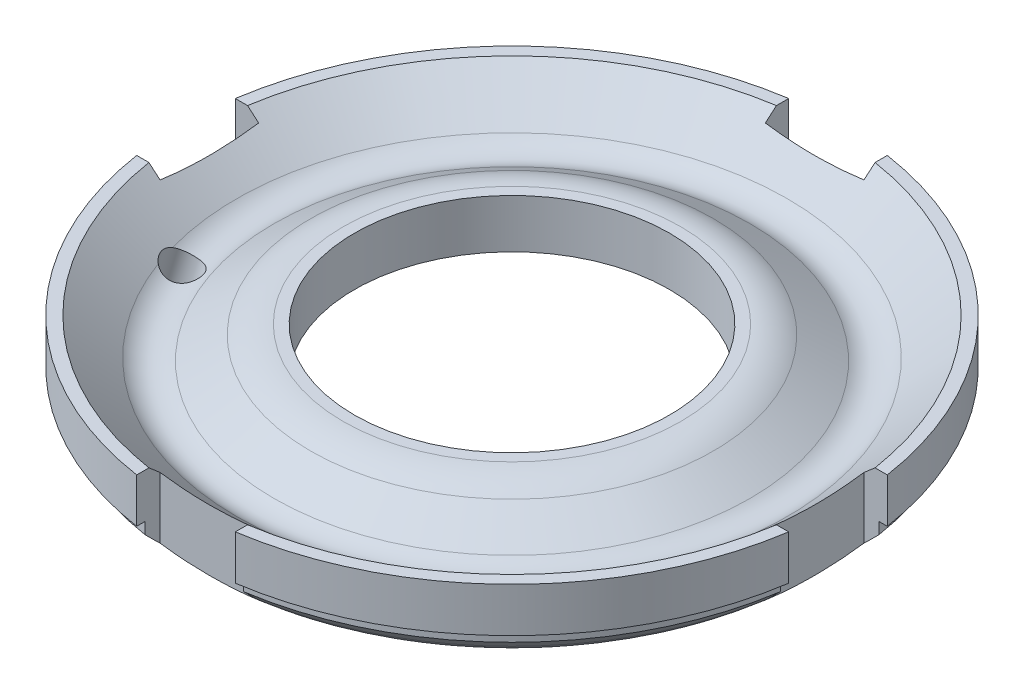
ISO-10303-21;
HEADER;
FILE_DESCRIPTION(('STEP AP214'),'2;1');
FILE_NAME('part.step','',(''),(''),'','','');
FILE_SCHEMA(('AUTOMOTIVE_DESIGN { 1 0 10303 214 1 1 1 1 }'));
ENDSEC;
DATA;
#1=APPLICATION_CONTEXT('core data for automotive mechanical design processes');
#2=APPLICATION_PROTOCOL_DEFINITION('international standard','automotive_design',2000,#1);
#3=PRODUCT_CONTEXT('',#1,'mechanical');
#4=PRODUCT('Part','Part','',(#3));
#5=PRODUCT_RELATED_PRODUCT_CATEGORY('part','',(#4));
#6=PRODUCT_DEFINITION_FORMATION('','',#4);
#7=PRODUCT_DEFINITION_CONTEXT('part definition',#1,'design');
#8=PRODUCT_DEFINITION('design','',#6,#7);
#9=PRODUCT_DEFINITION_SHAPE('','',#8);
#10=(LENGTH_UNIT() NAMED_UNIT(*) SI_UNIT(.MILLI.,.METRE.));
#11=(NAMED_UNIT(*) PLANE_ANGLE_UNIT() SI_UNIT($,.RADIAN.));
#12=(NAMED_UNIT(*) SI_UNIT($,.STERADIAN.) SOLID_ANGLE_UNIT());
#13=UNCERTAINTY_MEASURE_WITH_UNIT(LENGTH_MEASURE(1.E-05),#10,'distance_accuracy_value','');
#14=(GEOMETRIC_REPRESENTATION_CONTEXT(3) GLOBAL_UNCERTAINTY_ASSIGNED_CONTEXT((#13)) GLOBAL_UNIT_ASSIGNED_CONTEXT((#10,
#11,#12)) REPRESENTATION_CONTEXT('',''));
#15=CARTESIAN_POINT('',(0.,0.,0.));
#16=DIRECTION('',(0.,0.,1.));
#17=DIRECTION('',(1.,0.,0.));
#18=AXIS2_PLACEMENT_3D('',#15,#16,#17);
#19=CARTESIAN_POINT('',(20.701,10.8965999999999,0.));
#20=DIRECTION('',(0.,1.,0.));
#21=DIRECTION('',(0.,0.,1.));
#22=AXIS2_PLACEMENT_3D('',#19,#20,#21);
#23=PLANE('',#22);
#24=CARTESIAN_POINT('',(0.,10.8965999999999,0.));
#25=DIRECTION('',(0.,1.,0.));
#26=DIRECTION('',(0.,0.,1.));
#27=AXIS2_PLACEMENT_3D('',#24,#25,#26);
#28=CIRCLE('',#27,20.701);
#29=CARTESIAN_POINT('',(0.,10.8965999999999,20.701));
#30=VERTEX_POINT('',#29);
#31=EDGE_CURVE('E20',#30,#30,#28,.F.);
#32=ORIENTED_EDGE('',*,*,#31,.T.);
#33=EDGE_LOOP('',(#32));
#34=FACE_BOUND('',#33,.T.);
#35=CARTESIAN_POINT('',(0.,10.8966,0.));
#36=DIRECTION('',(0.,-1.,0.));
#37=DIRECTION('',(0.,0.,1.));
#38=AXIS2_PLACEMENT_3D('',#35,#36,#37);
#39=CIRCLE('',#38,22.1697825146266);
#40=CARTESIAN_POINT('',(0.,10.8966,22.1697825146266));
#41=VERTEX_POINT('',#40);
#42=EDGE_CURVE('E246',#41,#41,#39,.T.);
#43=ORIENTED_EDGE('',*,*,#42,.F.);
#44=EDGE_LOOP('',(#43));
#45=FACE_BOUND('',#44,.T.);
#46=ADVANCED_FACE('F16',(#34,#45),#23,.T.);
#47=CARTESIAN_POINT('',(0.,64.2455465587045,0.));
#48=DIRECTION('',(0.,1.,0.));
#49=DIRECTION('',(0.,0.,1.));
#50=AXIS2_PLACEMENT_3D('',#47,#48,#49);
#51=CYLINDRICAL_SURFACE('',#50,20.701);
#52=ORIENTED_EDGE('',*,*,#31,.F.);
#53=EDGE_LOOP('',(#52));
#54=FACE_BOUND('',#53,.T.);
#55=CARTESIAN_POINT('',(0.,4.48005296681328,0.));
#56=DIRECTION('',(0.,1.,0.));
#57=DIRECTION('',(0.,0.,1.));
#58=AXIS2_PLACEMENT_3D('',#55,#56,#57);
#59=CIRCLE('',#58,20.701);
#60=CARTESIAN_POINT('',(0.,4.48005296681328,20.701));
#61=VERTEX_POINT('',#60);
#62=EDGE_CURVE('E204',#61,#61,#59,.F.);
#63=ORIENTED_EDGE('',*,*,#62,.T.);
#64=EDGE_LOOP('',(#63));
#65=FACE_BOUND('',#64,.T.);
#66=ADVANCED_FACE('F234',(#54,#65),#51,.F.);
#67=CARTESIAN_POINT('',(0.,2.76859999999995,0.));
#68=DIRECTION('',(0.,1.,0.));
#69=DIRECTION('',(0.,0.,1.));
#70=AXIS2_PLACEMENT_3D('',#67,#68,#69);
#71=TOROIDAL_SURFACE('',#70,22.1697825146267,8.128);
#72=ORIENTED_EDGE('',*,*,#42,.T.);
#73=EDGE_LOOP('',(#72));
#74=FACE_BOUND('',#73,.T.);
#75=CARTESIAN_POINT('',(0.,9.67672130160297,0.));
#76=DIRECTION('',(0.,-1.,0.));
#77=DIRECTION('',(0.,0.,-1.));
#78=AXIS2_PLACEMENT_3D('',#75,#76,#77);
#79=CIRCLE('',#78,26.4525671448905);
#80=CARTESIAN_POINT('',(0.,9.67672130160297,-26.4525671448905));
#81=VERTEX_POINT('',#80);
#82=EDGE_CURVE('E201',#81,#81,#79,.T.);
#83=ORIENTED_EDGE('',*,*,#82,.F.);
#84=EDGE_LOOP('',(#83));
#85=FACE_BOUND('',#84,.T.);
#86=ADVANCED_FACE('F228',(#74,#85),#71,.T.);
#87=CARTESIAN_POINT('',(20.701,4.48005296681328,0.));
#88=DIRECTION('',(0.,1.,0.));
#89=DIRECTION('',(0.,0.,1.));
#90=AXIS2_PLACEMENT_3D('',#87,#88,#89);
#91=PLANE('',#90);
#92=ORIENTED_EDGE('',*,*,#62,.F.);
#93=EDGE_LOOP('',(#92));
#94=FACE_BOUND('',#93,.T.);
#95=CARTESIAN_POINT('',(0.,4.48005296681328,0.));
#96=DIRECTION('',(0.,1.,0.));
#97=DIRECTION('',(0.,0.,1.));
#98=AXIS2_PLACEMENT_3D('',#95,#96,#97);
#99=CIRCLE('',#98,23.1666266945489);
#100=CARTESIAN_POINT('',(0.,4.48005296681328,23.1666266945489));
#101=VERTEX_POINT('',#100);
#102=EDGE_CURVE('E211',#101,#101,#99,.F.);
#103=ORIENTED_EDGE('',*,*,#102,.T.);
#104=EDGE_LOOP('',(#103));
#105=FACE_BOUND('',#104,.T.);
#106=ADVANCED_FACE('F217',(#94,#105),#91,.F.);
#107=CARTESIAN_POINT('',(0.,6.69197571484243,0.));
#108=DIRECTION('',(0.,-1.,0.));
#109=DIRECTION('',(1.,0.,0.));
#110=AXIS2_PLACEMENT_3D('',#107,#108,#109);
#111=CONICAL_SURFACE('',#110,31.2669545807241,1.01582679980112);
#112=CARTESIAN_POINT('',(0.,6.69197571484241,0.));
#113=DIRECTION('',(0.,1.,0.));
#114=DIRECTION('',(0.,0.,1.));
#115=AXIS2_PLACEMENT_3D('',#112,#113,#114);
#116=CIRCLE('',#115,31.2669545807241);
#117=CARTESIAN_POINT('',(0.,6.69197571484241,31.2669545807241));
#118=VERTEX_POINT('',#117);
#119=EDGE_CURVE('E393',#118,#118,#116,.T.);
#120=ORIENTED_EDGE('',*,*,#119,.T.);
#121=EDGE_LOOP('',(#120));
#122=FACE_BOUND('',#121,.T.);
#123=ORIENTED_EDGE('',*,*,#82,.T.);
#124=EDGE_LOOP('',(#123));
#125=FACE_BOUND('',#124,.T.);
#126=ADVANCED_FACE('F227',(#122,#125),#111,.T.);
#127=CARTESIAN_POINT('',(42.2148,6.0706,0.));
#128=DIRECTION('',(0.,1.,0.));
#129=DIRECTION('',(0.,0.,1.));
#130=AXIS2_PLACEMENT_3D('',#127,#128,#129);
#131=PLANE('',#130);
#132=CARTESIAN_POINT('',(0.,6.0706,0.));
#133=DIRECTION('',(0.,1.,0.));
#134=DIRECTION('',(0.,0.,1.));
#135=AXIS2_PLACEMENT_3D('',#132,#133,#134);
#136=CIRCLE('',#135,42.2147999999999);
#137=CARTESIAN_POINT('',(-6.47700000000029,6.0706,41.714959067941));
#138=VERTEX_POINT('',#137);
#139=CARTESIAN_POINT('',(-41.7149590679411,6.0706,6.47699999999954));
#140=VERTEX_POINT('',#139);
#141=EDGE_CURVE('E777',#138,#140,#136,.F.);
#142=ORIENTED_EDGE('',*,*,#141,.F.);
#143=DIRECTION('',(0.,0.,1.));
#144=VECTOR('',#143,1.);
#145=CARTESIAN_POINT('',(-6.4770000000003,6.0706,0.));
#146=LINE('',#145,#144);
#147=CARTESIAN_POINT('',(-6.47700000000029,6.0706,42.8199103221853));
#148=VERTEX_POINT('',#147);
#149=EDGE_CURVE('E199',#148,#138,#146,.F.);
#150=ORIENTED_EDGE('',*,*,#149,.F.);
#151=CARTESIAN_POINT('',(0.,6.0706,0.));
#152=DIRECTION('',(0.,1.,0.));
#153=DIRECTION('',(0.,0.,1.));
#154=AXIS2_PLACEMENT_3D('',#151,#152,#153);
#155=CIRCLE('',#154,43.307);
#156=CARTESIAN_POINT('',(-42.8199103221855,6.0706,6.47699999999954));
#157=VERTEX_POINT('',#156);
#158=EDGE_CURVE('E787',#157,#148,#155,.T.);
#159=ORIENTED_EDGE('',*,*,#158,.F.);
#160=DIRECTION('',(1.,0.,0.));
#161=VECTOR('',#160,1.);
#162=CARTESIAN_POINT('',(42.2148,6.0706,6.47699999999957));
#163=LINE('',#162,#161);
#164=EDGE_CURVE('E164',#140,#157,#163,.F.);
#165=ORIENTED_EDGE('',*,*,#164,.F.);
#166=EDGE_LOOP('',(#142,#150,#159,#165));
#167=FACE_BOUND('',#166,.T.);
#168=ADVANCED_FACE('F829',(#167),#131,.F.);
#169=CARTESIAN_POINT('',(42.2148,6.0706,0.));
#170=DIRECTION('',(0.,1.,0.));
#171=DIRECTION('',(0.,0.,1.));
#172=AXIS2_PLACEMENT_3D('',#169,#170,#171);
#173=PLANE('',#172);
#174=CARTESIAN_POINT('',(0.,6.0706,0.));
#175=DIRECTION('',(0.,1.,0.));
#176=DIRECTION('',(0.,0.,1.));
#177=AXIS2_PLACEMENT_3D('',#174,#175,#176);
#178=CIRCLE('',#177,43.307);
#179=CARTESIAN_POINT('',(-6.477,6.0706,-42.8199103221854));
#180=VERTEX_POINT('',#179);
#181=CARTESIAN_POINT('',(-42.8199103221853,6.0706,-6.47700000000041));
#182=VERTEX_POINT('',#181);
#183=EDGE_CURVE('E163',#180,#182,#178,.T.);
#184=ORIENTED_EDGE('',*,*,#183,.F.);
#185=DIRECTION('',(0.,0.,1.));
#186=VECTOR('',#185,1.);
#187=CARTESIAN_POINT('',(-6.477,6.0706,0.));
#188=LINE('',#187,#186);
#189=CARTESIAN_POINT('',(-6.477,6.0706,-41.714959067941));
#190=VERTEX_POINT('',#189);
#191=EDGE_CURVE('E151',#190,#180,#188,.F.);
#192=ORIENTED_EDGE('',*,*,#191,.F.);
#193=CARTESIAN_POINT('',(0.,6.0706,0.));
#194=DIRECTION('',(0.,1.,0.));
#195=DIRECTION('',(0.,0.,1.));
#196=AXIS2_PLACEMENT_3D('',#193,#194,#195);
#197=CIRCLE('',#196,42.2147999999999);
#198=CARTESIAN_POINT('',(-41.714959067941,6.0706,-6.47700000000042));
#199=VERTEX_POINT('',#198);
#200=EDGE_CURVE('E376',#199,#190,#197,.F.);
#201=ORIENTED_EDGE('',*,*,#200,.F.);
#202=DIRECTION('',(1.,0.,0.));
#203=VECTOR('',#202,1.);
#204=CARTESIAN_POINT('',(-39.751,6.0706,-6.47700000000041));
#205=LINE('',#204,#203);
#206=EDGE_CURVE('E169',#182,#199,#205,.T.);
#207=ORIENTED_EDGE('',*,*,#206,.F.);
#208=EDGE_LOOP('',(#184,#192,#201,#207));
#209=FACE_BOUND('',#208,.T.);
#210=ADVANCED_FACE('F168',(#209),#173,.F.);
#211=CARTESIAN_POINT('',(0.,64.2455465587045,0.));
#212=DIRECTION('',(0.,1.,0.));
#213=DIRECTION('',(0.,0.,1.));
#214=AXIS2_PLACEMENT_3D('',#211,#212,#213);
#215=CYLINDRICAL_SURFACE('',#214,43.307);
#216=CARTESIAN_POINT('',(0.,11.9125999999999,0.));
#217=DIRECTION('',(0.,1.,0.));
#218=DIRECTION('',(0.,0.,1.));
#219=AXIS2_PLACEMENT_3D('',#216,#217,#218);
#220=CIRCLE('',#219,43.307);
#221=CARTESIAN_POINT('',(-6.477,11.9125999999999,-42.8199103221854));
#222=VERTEX_POINT('',#221);
#223=CARTESIAN_POINT('',(-42.8199103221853,11.9125999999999,-6.47700000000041));
#224=VERTEX_POINT('',#223);
#225=EDGE_CURVE('E176',#222,#224,#220,.T.);
#226=ORIENTED_EDGE('',*,*,#225,.F.);
#227=DIRECTION('',(0.,1.,0.));
#228=VECTOR('',#227,1.);
#229=CARTESIAN_POINT('',(-6.477,11.9125999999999,-42.8199103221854));
#230=LINE('',#229,#228);
#231=EDGE_CURVE('E156',#180,#222,#230,.T.);
#232=ORIENTED_EDGE('',*,*,#231,.F.);
#233=ORIENTED_EDGE('',*,*,#183,.T.);
#234=DIRECTION('',(0.,1.,0.));
#235=VECTOR('',#234,1.);
#236=CARTESIAN_POINT('',(-42.8199103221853,11.9125999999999,-6.47700000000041));
#237=LINE('',#236,#235);
#238=EDGE_CURVE('E190',#224,#182,#237,.F.);
#239=ORIENTED_EDGE('',*,*,#238,.F.);
#240=EDGE_LOOP('',(#226,#232,#233,#239));
#241=FACE_BOUND('',#240,.T.);
#242=ADVANCED_FACE('F175',(#241),#215,.T.);
#243=CARTESIAN_POINT('',(42.2148,6.0706,0.));
#244=DIRECTION('',(0.,1.,0.));
#245=DIRECTION('',(0.,0.,1.));
#246=AXIS2_PLACEMENT_3D('',#243,#244,#245);
#247=PLANE('',#246);
#248=CARTESIAN_POINT('',(0.,6.0706,0.));
#249=DIRECTION('',(0.,1.,0.));
#250=DIRECTION('',(0.,0.,1.));
#251=AXIS2_PLACEMENT_3D('',#248,#249,#250);
#252=CIRCLE('',#251,42.2147999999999);
#253=CARTESIAN_POINT('',(6.477,6.0706,-41.714959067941));
#254=VERTEX_POINT('',#253);
#255=CARTESIAN_POINT('',(41.7149590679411,6.0706,-6.47699999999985));
#256=VERTEX_POINT('',#255);
#257=EDGE_CURVE('E360',#254,#256,#252,.F.);
#258=ORIENTED_EDGE('',*,*,#257,.F.);
#259=DIRECTION('',(0.,0.,1.));
#260=VECTOR('',#259,1.);
#261=CARTESIAN_POINT('',(6.477,6.0706,-39.751));
#262=LINE('',#261,#260);
#263=CARTESIAN_POINT('',(6.477,6.0706,-42.8199103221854));
#264=VERTEX_POINT('',#263);
#265=EDGE_CURVE('E734',#264,#254,#262,.T.);
#266=ORIENTED_EDGE('',*,*,#265,.F.);
#267=CARTESIAN_POINT('',(0.,6.0706,0.));
#268=DIRECTION('',(0.,1.,0.));
#269=DIRECTION('',(0.,0.,1.));
#270=AXIS2_PLACEMENT_3D('',#267,#268,#269);
#271=CIRCLE('',#270,43.307);
#272=CARTESIAN_POINT('',(42.8199103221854,6.0706,-6.47699999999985));
#273=VERTEX_POINT('',#272);
#274=EDGE_CURVE('E793',#273,#264,#271,.T.);
#275=ORIENTED_EDGE('',*,*,#274,.F.);
#276=DIRECTION('',(1.,0.,0.));
#277=VECTOR('',#276,1.);
#278=CARTESIAN_POINT('',(42.2148,6.0706,-6.47699999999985));
#279=LINE('',#278,#277);
#280=EDGE_CURVE('E173',#256,#273,#279,.T.);
#281=ORIENTED_EDGE('',*,*,#280,.F.);
#282=EDGE_LOOP('',(#258,#266,#275,#281));
#283=FACE_BOUND('',#282,.T.);
#284=ADVANCED_FACE('F848',(#283),#247,.F.);
#285=CARTESIAN_POINT('',(0.,64.2455465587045,0.));
#286=DIRECTION('',(0.,1.,0.));
#287=DIRECTION('',(0.,0.,1.));
#288=AXIS2_PLACEMENT_3D('',#285,#286,#287);
#289=CYLINDRICAL_SURFACE('',#288,43.307);
#290=ORIENTED_EDGE('',*,*,#274,.T.);
#291=DIRECTION('',(0.,1.,0.));
#292=VECTOR('',#291,1.);
#293=CARTESIAN_POINT('',(6.477,11.9125999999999,-42.8199103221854));
#294=LINE('',#293,#292);
#295=CARTESIAN_POINT('',(6.477,11.9125999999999,-42.8199103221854));
#296=VERTEX_POINT('',#295);
#297=EDGE_CURVE('E185',#296,#264,#294,.F.);
#298=ORIENTED_EDGE('',*,*,#297,.F.);
#299=CARTESIAN_POINT('',(0.,11.9125999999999,0.));
#300=DIRECTION('',(0.,1.,0.));
#301=DIRECTION('',(0.,0.,1.));
#302=AXIS2_PLACEMENT_3D('',#299,#300,#301);
#303=CIRCLE('',#302,43.307);
#304=CARTESIAN_POINT('',(42.8199103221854,11.9125999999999,-6.47699999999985));
#305=VERTEX_POINT('',#304);
#306=EDGE_CURVE('E782',#305,#296,#303,.T.);
#307=ORIENTED_EDGE('',*,*,#306,.F.);
#308=DIRECTION('',(0.,1.,0.));
#309=VECTOR('',#308,1.);
#310=CARTESIAN_POINT('',(42.8199103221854,11.9125999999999,-6.47699999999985));
#311=LINE('',#310,#309);
#312=EDGE_CURVE('E364',#273,#305,#311,.T.);
#313=ORIENTED_EDGE('',*,*,#312,.F.);
#314=EDGE_LOOP('',(#290,#298,#307,#313));
#315=FACE_BOUND('',#314,.T.);
#316=ADVANCED_FACE('F855',(#315),#289,.T.);
#317=CARTESIAN_POINT('',(42.2148,6.0706,0.));
#318=DIRECTION('',(0.,1.,0.));
#319=DIRECTION('',(0.,0.,1.));
#320=AXIS2_PLACEMENT_3D('',#317,#318,#319);
#321=PLANE('',#320);
#322=CARTESIAN_POINT('',(0.,6.0706,0.));
#323=DIRECTION('',(0.,1.,0.));
#324=DIRECTION('',(0.,0.,1.));
#325=AXIS2_PLACEMENT_3D('',#322,#323,#324);
#326=CIRCLE('',#325,42.2147999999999);
#327=CARTESIAN_POINT('',(41.714959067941,6.0706,6.47700000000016));
#328=VERTEX_POINT('',#327);
#329=CARTESIAN_POINT('',(6.47699999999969,6.0706,41.7149590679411));
#330=VERTEX_POINT('',#329);
#331=EDGE_CURVE('E346',#328,#330,#326,.F.);
#332=ORIENTED_EDGE('',*,*,#331,.F.);
#333=DIRECTION('',(-1.,0.,0.));
#334=VECTOR('',#333,1.);
#335=CARTESIAN_POINT('',(39.751,6.0706,6.47700000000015));
#336=LINE('',#335,#334);
#337=CARTESIAN_POINT('',(42.8199103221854,6.0706,6.47700000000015));
#338=VERTEX_POINT('',#337);
#339=EDGE_CURVE('E686',#338,#328,#336,.T.);
#340=ORIENTED_EDGE('',*,*,#339,.F.);
#341=CARTESIAN_POINT('',(0.,6.0706,0.));
#342=DIRECTION('',(0.,1.,0.));
#343=DIRECTION('',(0.,0.,1.));
#344=AXIS2_PLACEMENT_3D('',#341,#342,#343);
#345=CIRCLE('',#344,43.307);
#346=CARTESIAN_POINT('',(6.47699999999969,6.0706,42.8199103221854));
#347=VERTEX_POINT('',#346);
#348=EDGE_CURVE('E790',#347,#338,#345,.T.);
#349=ORIENTED_EDGE('',*,*,#348,.F.);
#350=DIRECTION('',(0.,0.,1.));
#351=VECTOR('',#350,1.);
#352=CARTESIAN_POINT('',(6.47699999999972,6.0706,0.));
#353=LINE('',#352,#351);
#354=EDGE_CURVE('E792',#330,#347,#353,.T.);
#355=ORIENTED_EDGE('',*,*,#354,.F.);
#356=EDGE_LOOP('',(#332,#340,#349,#355));
#357=FACE_BOUND('',#356,.T.);
#358=ADVANCED_FACE('F863',(#357),#321,.F.);
#359=CARTESIAN_POINT('',(0.,64.2455465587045,0.));
#360=DIRECTION('',(0.,1.,0.));
#361=DIRECTION('',(0.,0.,1.));
#362=AXIS2_PLACEMENT_3D('',#359,#360,#361);
#363=CYLINDRICAL_SURFACE('',#362,43.307);
#364=ORIENTED_EDGE('',*,*,#348,.T.);
#365=DIRECTION('',(0.,1.,0.));
#366=VECTOR('',#365,1.);
#367=CARTESIAN_POINT('',(42.8199103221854,11.9125999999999,6.47700000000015));
#368=LINE('',#367,#366);
#369=CARTESIAN_POINT('',(42.8199103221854,11.9125999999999,6.47700000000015));
#370=VERTEX_POINT('',#369);
#371=EDGE_CURVE('E1054',#370,#338,#368,.F.);
#372=ORIENTED_EDGE('',*,*,#371,.F.);
#373=CARTESIAN_POINT('',(0.,11.9125999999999,0.));
#374=DIRECTION('',(0.,1.,0.));
#375=DIRECTION('',(0.,0.,1.));
#376=AXIS2_PLACEMENT_3D('',#373,#374,#375);
#377=CIRCLE('',#376,43.307);
#378=CARTESIAN_POINT('',(6.47699999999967,11.9125999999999,42.8199103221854));
#379=VERTEX_POINT('',#378);
#380=EDGE_CURVE('E780',#379,#370,#377,.T.);
#381=ORIENTED_EDGE('',*,*,#380,.F.);
#382=DIRECTION('',(0.,1.,0.));
#383=VECTOR('',#382,1.);
#384=CARTESIAN_POINT('',(6.47699999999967,11.9125999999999,42.8199103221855));
#385=LINE('',#384,#383);
#386=EDGE_CURVE('E350',#347,#379,#385,.T.);
#387=ORIENTED_EDGE('',*,*,#386,.F.);
#388=EDGE_LOOP('',(#364,#372,#381,#387));
#389=FACE_BOUND('',#388,.T.);
#390=ADVANCED_FACE('F871',(#389),#363,.T.);
#391=CARTESIAN_POINT('',(0.,64.2455465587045,0.));
#392=DIRECTION('',(0.,1.,0.));
#393=DIRECTION('',(0.,0.,1.));
#394=AXIS2_PLACEMENT_3D('',#391,#392,#393);
#395=CYLINDRICAL_SURFACE('',#394,43.307);
#396=ORIENTED_EDGE('',*,*,#158,.T.);
#397=DIRECTION('',(0.,1.,0.));
#398=VECTOR('',#397,1.);
#399=CARTESIAN_POINT('',(-6.47700000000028,11.9125999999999,42.8199103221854));
#400=LINE('',#399,#398);
#401=CARTESIAN_POINT('',(-6.47700000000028,11.9125999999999,42.8199103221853));
#402=VERTEX_POINT('',#401);
#403=EDGE_CURVE('E384',#402,#148,#400,.F.);
#404=ORIENTED_EDGE('',*,*,#403,.F.);
#405=CARTESIAN_POINT('',(0.,11.9125999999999,0.));
#406=DIRECTION('',(0.,1.,0.));
#407=DIRECTION('',(0.,0.,1.));
#408=AXIS2_PLACEMENT_3D('',#405,#406,#407);
#409=CIRCLE('',#408,43.307);
#410=CARTESIAN_POINT('',(-42.8199103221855,11.9125999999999,6.47699999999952));
#411=VERTEX_POINT('',#410);
#412=EDGE_CURVE('E785',#411,#402,#409,.T.);
#413=ORIENTED_EDGE('',*,*,#412,.F.);
#414=DIRECTION('',(0.,1.,0.));
#415=VECTOR('',#414,1.);
#416=CARTESIAN_POINT('',(-42.8199103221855,11.9125999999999,6.47699999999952));
#417=LINE('',#416,#415);
#418=EDGE_CURVE('E193',#157,#411,#417,.T.);
#419=ORIENTED_EDGE('',*,*,#418,.F.);
#420=EDGE_LOOP('',(#396,#404,#413,#419));
#421=FACE_BOUND('',#420,.T.);
#422=ADVANCED_FACE('F879',(#421),#395,.T.);
#423=CARTESIAN_POINT('',(41.7195,11.9125999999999,0.));
#424=DIRECTION('',(0.,1.,0.));
#425=DIRECTION('',(0.,0.,1.));
#426=AXIS2_PLACEMENT_3D('',#423,#424,#425);
#427=PLANE('',#426);
#428=ORIENTED_EDGE('',*,*,#412,.T.);
#429=DIRECTION('',(0.,0.,-1.));
#430=VECTOR('',#429,1.);
#431=CARTESIAN_POINT('',(-6.47700000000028,11.9125999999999,39.751));
#432=LINE('',#431,#430);
#433=CARTESIAN_POINT('',(-6.47700000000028,11.9126000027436,41.2136524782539));
#434=VERTEX_POINT('',#433);
#435=EDGE_CURVE('E1051',#434,#402,#432,.F.);
#436=ORIENTED_EDGE('',*,*,#435,.F.);
#437=CARTESIAN_POINT('',(0.,11.9126000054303,0.));
#438=DIRECTION('',(0.,1.,0.));
#439=DIRECTION('',(0.,0.,1.));
#440=AXIS2_PLACEMENT_3D('',#437,#438,#439);
#441=CIRCLE('',#440,41.7194999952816);
#442=CARTESIAN_POINT('',(-41.2136524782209,11.9126000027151,6.47699999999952));
#443=VERTEX_POINT('',#442);
#444=EDGE_CURVE('E1046',#434,#443,#441,.F.);
#445=ORIENTED_EDGE('',*,*,#444,.T.);
#446=DIRECTION('',(-1.,0.,0.));
#447=VECTOR('',#446,1.);
#448=CARTESIAN_POINT('',(-47.5512209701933,11.9125999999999,6.47699999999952));
#449=LINE('',#448,#447);
#450=EDGE_CURVE('E196',#411,#443,#449,.F.);
#451=ORIENTED_EDGE('',*,*,#450,.F.);
#452=EDGE_LOOP('',(#428,#436,#445,#451));
#453=FACE_BOUND('',#452,.T.);
#454=ADVANCED_FACE('F887',(#453),#427,.T.);
#455=CARTESIAN_POINT('',(41.7195,11.9125999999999,0.));
#456=DIRECTION('',(0.,1.,0.));
#457=DIRECTION('',(0.,0.,1.));
#458=AXIS2_PLACEMENT_3D('',#455,#456,#457);
#459=PLANE('',#458);
#460=CARTESIAN_POINT('',(0.,11.9126000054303,0.));
#461=DIRECTION('',(0.,1.,0.));
#462=DIRECTION('',(0.,0.,1.));
#463=AXIS2_PLACEMENT_3D('',#460,#461,#462);
#464=CIRCLE('',#463,41.7194999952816);
#465=CARTESIAN_POINT('',(-41.2136524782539,11.9126000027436,-6.47700000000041));
#466=VERTEX_POINT('',#465);
#467=CARTESIAN_POINT('',(-6.477,11.9126000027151,-41.2136524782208));
#468=VERTEX_POINT('',#467);
#469=EDGE_CURVE('E536',#466,#468,#464,.F.);
#470=ORIENTED_EDGE('',*,*,#469,.T.);
#471=DIRECTION('',(0.,0.,-1.));
#472=VECTOR('',#471,1.);
#473=CARTESIAN_POINT('',(-6.477,11.9125999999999,-47.5512209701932));
#474=LINE('',#473,#472);
#475=EDGE_CURVE('E178',#222,#468,#474,.F.);
#476=ORIENTED_EDGE('',*,*,#475,.F.);
#477=ORIENTED_EDGE('',*,*,#225,.T.);
#478=DIRECTION('',(1.,0.,0.));
#479=VECTOR('',#478,1.);
#480=CARTESIAN_POINT('',(-39.751,11.9125999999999,-6.47700000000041));
#481=LINE('',#480,#479);
#482=EDGE_CURVE('E192',#466,#224,#481,.F.);
#483=ORIENTED_EDGE('',*,*,#482,.F.);
#484=EDGE_LOOP('',(#470,#476,#477,#483));
#485=FACE_BOUND('',#484,.T.);
#486=ADVANCED_FACE('F895',(#485),#459,.T.);
#487=CARTESIAN_POINT('',(41.7195,11.9125999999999,0.));
#488=DIRECTION('',(0.,1.,0.));
#489=DIRECTION('',(0.,0.,1.));
#490=AXIS2_PLACEMENT_3D('',#487,#488,#489);
#491=PLANE('',#490);
#492=ORIENTED_EDGE('',*,*,#306,.T.);
#493=DIRECTION('',(0.,0.,1.));
#494=VECTOR('',#493,1.);
#495=CARTESIAN_POINT('',(6.477,11.9125999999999,-39.751));
#496=LINE('',#495,#494);
#497=CARTESIAN_POINT('',(6.477,11.9126000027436,-41.213652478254));
#498=VERTEX_POINT('',#497);
#499=EDGE_CURVE('E180',#498,#296,#496,.F.);
#500=ORIENTED_EDGE('',*,*,#499,.F.);
#501=CARTESIAN_POINT('',(0.,11.9126000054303,0.));
#502=DIRECTION('',(0.,1.,0.));
#503=DIRECTION('',(0.,0.,1.));
#504=AXIS2_PLACEMENT_3D('',#501,#502,#503);
#505=CIRCLE('',#504,41.7194999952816);
#506=CARTESIAN_POINT('',(41.2136524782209,11.9126000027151,-6.47699999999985));
#507=VERTEX_POINT('',#506);
#508=EDGE_CURVE('E601',#498,#507,#505,.F.);
#509=ORIENTED_EDGE('',*,*,#508,.T.);
#510=DIRECTION('',(1.,0.,0.));
#511=VECTOR('',#510,1.);
#512=CARTESIAN_POINT('',(47.5512209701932,11.9125999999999,-6.47699999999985));
#513=LINE('',#512,#511);
#514=EDGE_CURVE('E1055',#305,#507,#513,.F.);
#515=ORIENTED_EDGE('',*,*,#514,.F.);
#516=EDGE_LOOP('',(#492,#500,#509,#515));
#517=FACE_BOUND('',#516,.T.);
#518=ADVANCED_FACE('F903',(#517),#491,.T.);
#519=CARTESIAN_POINT('',(41.7195,11.9125999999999,0.));
#520=DIRECTION('',(0.,1.,0.));
#521=DIRECTION('',(0.,0.,1.));
#522=AXIS2_PLACEMENT_3D('',#519,#520,#521);
#523=PLANE('',#522);
#524=ORIENTED_EDGE('',*,*,#380,.T.);
#525=DIRECTION('',(-1.,0.,0.));
#526=VECTOR('',#525,1.);
#527=CARTESIAN_POINT('',(39.751,11.9125999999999,6.47700000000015));
#528=LINE('',#527,#526);
#529=CARTESIAN_POINT('',(41.213652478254,11.9126000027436,6.47700000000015));
#530=VERTEX_POINT('',#529);
#531=EDGE_CURVE('E1052',#530,#370,#528,.F.);
#532=ORIENTED_EDGE('',*,*,#531,.F.);
#533=CARTESIAN_POINT('',(0.,11.9126000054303,0.));
#534=DIRECTION('',(0.,1.,0.));
#535=DIRECTION('',(0.,0.,1.));
#536=AXIS2_PLACEMENT_3D('',#533,#534,#535);
#537=CIRCLE('',#536,41.7194999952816);
#538=CARTESIAN_POINT('',(6.47699999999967,11.9126000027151,41.2136524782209));
#539=VERTEX_POINT('',#538);
#540=EDGE_CURVE('E619',#530,#539,#537,.F.);
#541=ORIENTED_EDGE('',*,*,#540,.T.);
#542=DIRECTION('',(0.,0.,1.));
#543=VECTOR('',#542,1.);
#544=CARTESIAN_POINT('',(6.47699999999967,11.9125999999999,47.5512209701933));
#545=LINE('',#544,#543);
#546=EDGE_CURVE('E636',#379,#539,#545,.F.);
#547=ORIENTED_EDGE('',*,*,#546,.F.);
#548=EDGE_LOOP('',(#524,#532,#541,#547));
#549=FACE_BOUND('',#548,.T.);
#550=ADVANCED_FACE('F910',(#549),#523,.T.);
#551=CARTESIAN_POINT('',(0.,1.17805296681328,0.));
#552=DIRECTION('',(0.,1.,0.));
#553=DIRECTION('',(0.,0.,1.));
#554=AXIS2_PLACEMENT_3D('',#551,#552,#553);
#555=TOROIDAL_SURFACE('',#554,23.1666266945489,3.302);
#556=ORIENTED_EDGE('',*,*,#102,.F.);
#557=EDGE_LOOP('',(#556));
#558=FACE_BOUND('',#557,.T.);
#559=CARTESIAN_POINT('',(0.,3.72322216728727,0.));
#560=DIRECTION('',(0.,-1.,0.));
#561=DIRECTION('',(0.,0.,-1.));
#562=AXIS2_PLACEMENT_3D('',#559,#560,#561);
#563=CIRCLE('',#562,25.2702706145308);
#564=CARTESIAN_POINT('',(0.,3.72322216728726,-25.2702706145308));
#565=VERTEX_POINT('',#564);
#566=EDGE_CURVE('E332',#565,#565,#563,.T.);
#567=ORIENTED_EDGE('',*,*,#566,.T.);
#568=EDGE_LOOP('',(#567));
#569=FACE_BOUND('',#568,.T.);
#570=ADVANCED_FACE('F401',(#558,#569),#555,.F.);
#571=CARTESIAN_POINT('',(0.,10.2107999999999,0.));
#572=DIRECTION('',(0.,1.,0.));
#573=DIRECTION('',(0.,0.,1.));
#574=AXIS2_PLACEMENT_3D('',#571,#572,#573);
#575=TOROIDAL_SURFACE('',#574,33.448498,4.1402);
#576=CARTESIAN_POINT('',(-34.814723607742,7.08552373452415,9.78617865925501));
#577=CARTESIAN_POINT('',(-34.7971129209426,7.05695617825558,9.7273277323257));
#578=CARTESIAN_POINT('',(-34.7770863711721,7.027640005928,9.66960162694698));
#579=CARTESIAN_POINT('',(-34.7321843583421,6.96798579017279,9.556597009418));
#580=CARTESIAN_POINT('',(-34.7073077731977,6.9376475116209,9.5013190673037));
#581=CARTESIAN_POINT('',(-34.6251912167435,6.84560941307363,9.33909990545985));
#582=CARTESIAN_POINT('',(-34.5605930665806,6.78310253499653,9.23620739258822));
#583=CARTESIAN_POINT('',(-34.4121234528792,6.65993038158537,9.04365984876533));
#584=CARTESIAN_POINT('',(-34.3282089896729,6.59926956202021,8.95403509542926));
#585=CARTESIAN_POINT('',(-34.1424280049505,6.48394997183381,8.79130952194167));
#586=CARTESIAN_POINT('',(-34.0406018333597,6.42927814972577,8.71817238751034));
#587=CARTESIAN_POINT('',(-33.8295573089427,6.3331734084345,8.59597325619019));
#588=CARTESIAN_POINT('',(-33.7214557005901,6.29105743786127,8.54552308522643));
#589=CARTESIAN_POINT('',(-33.4950845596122,6.21722493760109,8.46315128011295));
#590=CARTESIAN_POINT('',(-33.3768166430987,6.18550675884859,8.43122670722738));
#591=CARTESIAN_POINT('',(-33.1449220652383,6.13593336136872,8.3889069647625));
#592=CARTESIAN_POINT('',(-33.0317951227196,6.11710780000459,8.37687205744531));
#593=CARTESIAN_POINT('',(-32.8038420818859,6.08903347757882,8.36909438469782));
#594=CARTESIAN_POINT('',(-32.6890159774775,6.07978475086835,8.37335167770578));
#595=CARTESIAN_POINT('',(-32.4578691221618,6.06986662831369,8.39787937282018));
#596=CARTESIAN_POINT('',(-32.3415821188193,6.06941610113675,8.41854500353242));
#597=CARTESIAN_POINT('',(-32.1131212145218,6.07602715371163,8.4754448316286));
#598=CARTESIAN_POINT('',(-32.0009490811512,6.08309192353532,8.51168563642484));
#599=CARTESIAN_POINT('',(-31.7706502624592,6.10377910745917,8.60377939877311));
#600=CARTESIAN_POINT('',(-31.6532807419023,6.11805173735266,8.66138441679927));
#601=CARTESIAN_POINT('',(-31.4291249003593,6.15005386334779,8.79386897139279));
#602=CARTESIAN_POINT('',(-31.3223504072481,6.16778715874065,8.86876751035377));
#603=CARTESIAN_POINT('',(-31.1152907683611,6.20422186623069,9.04119924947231));
#604=CARTESIAN_POINT('',(-31.0160008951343,6.22290288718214,9.139959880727));
#605=CARTESIAN_POINT('',(-30.8824137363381,6.24697703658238,9.30112561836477));
#606=CARTESIAN_POINT('',(-30.8404499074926,6.25434271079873,9.35700508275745));
#607=CARTESIAN_POINT('',(-30.7621875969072,6.26721335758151,9.47282130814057));
#608=CARTESIAN_POINT('',(-30.7258875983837,6.2727188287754,9.53275697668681));
#609=CARTESIAN_POINT('',(-30.6636769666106,6.28087241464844,9.64850979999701));
#610=CARTESIAN_POINT('',(-30.6370363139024,6.28379006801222,9.70391695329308));
#611=CARTESIAN_POINT('',(-30.5889083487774,6.28765096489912,9.81698975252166));
#612=CARTESIAN_POINT('',(-30.567420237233,6.28859451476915,9.87465504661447));
#613=CARTESIAN_POINT('',(-30.5298593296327,6.28844135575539,9.9916365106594));
#614=CARTESIAN_POINT('',(-30.5137795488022,6.28734729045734,10.0509504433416));
#615=CARTESIAN_POINT('',(-30.4871115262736,6.28320125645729,10.1707062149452));
#616=CARTESIAN_POINT('',(-30.4765211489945,6.2801500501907,10.2311476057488));
#617=CARTESIAN_POINT('',(-30.4616513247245,6.27271921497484,10.3460741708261));
#618=CARTESIAN_POINT('',(-30.4568151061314,6.26851801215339,10.4004998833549));
#619=CARTESIAN_POINT('',(-30.4514028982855,6.2589415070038,10.5094180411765));
#620=CARTESIAN_POINT('',(-30.4508249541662,6.25356674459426,10.5639104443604));
#621=CARTESIAN_POINT('',(-30.4559852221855,6.23335176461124,10.7521841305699));
#622=CARTESIAN_POINT('',(-30.4721799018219,6.21615110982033,10.8855419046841));
#623=CARTESIAN_POINT('',(-30.5272157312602,6.18036863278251,11.1475158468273));
#624=CARTESIAN_POINT('',(-30.5661291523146,6.1617825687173,11.2761154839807));
#625=CARTESIAN_POINT('',(-30.6640939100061,6.12752710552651,11.5251313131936));
#626=CARTESIAN_POINT('',(-30.7230566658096,6.11184533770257,11.6455807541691));
#627=CARTESIAN_POINT('',(-30.8593317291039,6.08699026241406,11.8763699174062));
#628=CARTESIAN_POINT('',(-30.9366312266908,6.0778124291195,11.9867166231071));
#629=CARTESIAN_POINT('',(-31.0663422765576,6.07119188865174,12.1442032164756));
#630=CARTESIAN_POINT('',(-31.1128106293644,6.07022620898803,12.196189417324));
#631=CARTESIAN_POINT('',(-31.2098194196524,6.07123344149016,12.2961681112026));
#632=CARTESIAN_POINT('',(-31.2603579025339,6.07320495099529,12.3441624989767));
#633=CARTESIAN_POINT('',(-31.3651092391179,6.08038184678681,12.4356487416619));
#634=CARTESIAN_POINT('',(-31.4193205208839,6.08558585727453,12.4791425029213));
#635=CARTESIAN_POINT('',(-31.5309756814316,6.09943337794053,12.5611485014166));
#636=CARTESIAN_POINT('',(-31.5884190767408,6.10807637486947,12.5996614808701));
#637=CARTESIAN_POINT('',(-31.6995462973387,6.12775929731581,12.6673072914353));
#638=CARTESIAN_POINT('',(-31.752951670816,6.13843246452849,12.6970056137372));
#639=CARTESIAN_POINT('',(-31.8614898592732,6.16258065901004,12.7517990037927));
#640=CARTESIAN_POINT('',(-31.9166232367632,6.1760566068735,12.7768925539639));
#641=CARTESIAN_POINT('',(-32.0281021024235,6.20571522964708,12.8222075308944));
#642=CARTESIAN_POINT('',(-32.0844466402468,6.22189584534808,12.8424326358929));
#643=CARTESIAN_POINT('',(-32.197921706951,6.2568095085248,12.8778757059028));
#644=CARTESIAN_POINT('',(-32.2550525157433,6.2755434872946,12.8930918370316));
#645=CARTESIAN_POINT('',(-32.4180558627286,6.33217758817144,12.9290966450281));
#646=CARTESIAN_POINT('',(-32.5243712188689,6.37290934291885,12.9437500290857));
#647=CARTESIAN_POINT('',(-32.7353643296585,6.46047036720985,12.9556570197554));
#648=CARTESIAN_POINT('',(-32.8400417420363,6.50730089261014,12.952907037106));
#649=CARTESIAN_POINT('',(-33.0503366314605,6.60707114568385,12.9302224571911));
#650=CARTESIAN_POINT('',(-33.1557843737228,6.66019097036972,12.909519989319));
#651=CARTESIAN_POINT('',(-33.3609251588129,6.7680737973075,12.8510128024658));
#652=CARTESIAN_POINT('',(-33.4606174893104,6.82283700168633,12.8132059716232));
#653=CARTESIAN_POINT('',(-33.6202640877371,6.91283536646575,12.7372840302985));
#654=CARTESIAN_POINT('',(-33.682213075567,6.94838462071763,12.7036365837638));
#655=CARTESIAN_POINT('',(-33.8026489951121,7.01813368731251,12.6298263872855));
#656=CARTESIAN_POINT('',(-33.8611439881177,7.05233657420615,12.5896796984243));
#657=CARTESIAN_POINT('',(-33.9178745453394,7.08552373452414,12.5463962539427));
#658=B_SPLINE_CURVE_WITH_KNOTS('',3,(#576,#577,#578,#579,#580,#581,#582,#583,#584,#585,#586,
#587,#588,#589,#590,#591,#592,#593,#594,#595,#596,#597,#598,#599,#600,#601,#602,#603,#604,#605,
#606,#607,#608,#609,#610,#611,#612,#613,#614,#615,#616,#617,#618,#619,#620,#621,#622,#623,#624,
#625,#626,#627,#628,#629,#630,#631,#632,#633,#634,#635,#636,#637,#638,#639,#640,#641,#642,#643,
#644,#645,#646,#647,#648,#649,#650,#651,#652,#653,#654,#655,#656,#657),.UNSPECIFIED.,.F.,.F.,(4,
2,2,2,2,2,2,2,2,2,2,2,2,2,2,2,2,2,2,2,2,2,2,2,2,2,2,2,2,2,2,2,2,2,2,2,2,2,2,2,4),(0.,
0.203118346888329,0.406283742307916,0.81410165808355,1.22283634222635,1.63066178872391,
2.00808858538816,2.38545549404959,2.72979481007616,3.07413536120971,3.42703128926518,
3.78007707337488,4.17297519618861,4.56630711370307,4.98749793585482,5.19800397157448,
5.40845353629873,5.59282447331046,5.77716679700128,5.96127012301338,6.14530177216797,
6.30951662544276,6.4736560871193,6.87749932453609,7.282634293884,7.6860020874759,
8.08908891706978,8.29804506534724,8.50690145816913,8.7156690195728,8.92440543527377,
9.11025296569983,9.29616163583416,9.48192940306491,9.6677651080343,10.0104417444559,
10.3531890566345,10.7113626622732,11.0695805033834,11.306109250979,11.5420621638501),.UNSPECIFIED.);
#659=CARTESIAN_POINT('',(-34.814723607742,7.08552373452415,9.78617865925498));
#660=VERTEX_POINT('',#659);
#661=CARTESIAN_POINT('',(-33.9178745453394,7.08552373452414,12.5463962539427));
#662=VERTEX_POINT('',#661);
#663=EDGE_CURVE('E408',#660,#662,#658,.T.);
#664=ORIENTED_EDGE('',*,*,#663,.T.);
#665=CARTESIAN_POINT('',(0.,7.08552373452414,0.));
#666=DIRECTION('',(0.,1.,0.));
#667=DIRECTION('',(0.,0.,1.));
#668=AXIS2_PLACEMENT_3D('',#665,#666,#667);
#669=CIRCLE('',#668,36.1639913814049);
#670=EDGE_CURVE('E1040',#662,#660,#669,.T.);
#671=ORIENTED_EDGE('',*,*,#670,.T.);
#672=EDGE_LOOP('',(#664,#671));
#673=FACE_BOUND('',#672,.T.);
#674=ORIENTED_EDGE('',*,*,#119,.F.);
#675=EDGE_LOOP('',(#674));
#676=FACE_BOUND('',#675,.T.);
#677=ADVANCED_FACE('F396',(#673,#676),#575,.F.);
#678=CARTESIAN_POINT('',(0.,64.2455465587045,0.));
#679=DIRECTION('',(0.,1.,0.));
#680=DIRECTION('',(0.,0.,1.));
#681=AXIS2_PLACEMENT_3D('',#678,#679,#680);
#682=CYLINDRICAL_SURFACE('',#681,42.2147999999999);
#683=CARTESIAN_POINT('',(0.,4.5466000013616,0.));
#684=DIRECTION('',(0.,1.,0.));
#685=DIRECTION('',(0.,0.,1.));
#686=AXIS2_PLACEMENT_3D('',#683,#684,#685);
#687=CIRCLE('',#686,42.2147999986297);
#688=CARTESIAN_POINT('',(-6.47700000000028,4.54660000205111,41.7149590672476));
#689=VERTEX_POINT('',#688);
#690=CARTESIAN_POINT('',(-41.7149590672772,4.54660000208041,6.47699999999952));
#691=VERTEX_POINT('',#690);
#692=EDGE_CURVE('E331',#689,#691,#687,.F.);
#693=ORIENTED_EDGE('',*,*,#692,.F.);
#694=DIRECTION('',(0.,1.,0.));
#695=VECTOR('',#694,1.);
#696=CARTESIAN_POINT('',(-6.47700000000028,11.9125999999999,41.714959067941));
#697=LINE('',#696,#695);
#698=EDGE_CURVE('E380',#138,#689,#697,.F.);
#699=ORIENTED_EDGE('',*,*,#698,.F.);
#700=ORIENTED_EDGE('',*,*,#141,.T.);
#701=DIRECTION('',(0.,1.,0.));
#702=VECTOR('',#701,1.);
#703=CARTESIAN_POINT('',(-41.7149590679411,11.9125999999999,6.47699999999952));
#704=LINE('',#703,#702);
#705=EDGE_CURVE('E197',#691,#140,#704,.T.);
#706=ORIENTED_EDGE('',*,*,#705,.F.);
#707=EDGE_LOOP('',(#693,#699,#700,#706));
#708=FACE_BOUND('',#707,.T.);
#709=ADVANCED_FACE('F400',(#708),#682,.T.);
#710=CARTESIAN_POINT('',(-47.5512209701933,11.9125999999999,6.47699999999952));
#711=DIRECTION('',(0.,0.,-1.));
#712=DIRECTION('',(-1.,0.,0.));
#713=AXIS2_PLACEMENT_3D('',#710,#711,#712);
#714=PLANE('',#713);
#715=ORIENTED_EDGE('',*,*,#450,.T.);
#716=CARTESIAN_POINT('',(-41.2136524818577,11.9126000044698,6.47700000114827));
#717=CARTESIAN_POINT('',(-40.9699237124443,11.7033947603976,6.47700000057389));
#718=CARTESIAN_POINT('',(-40.7261716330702,11.4942166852,6.47700000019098));
#719=CARTESIAN_POINT('',(-40.238620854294,11.0759148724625,6.47699999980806));
#720=CARTESIAN_POINT('',(-39.9948221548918,10.8667911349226,6.47699999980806));
#721=CARTESIAN_POINT('',(-39.7510001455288,10.6576945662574,6.47699999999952));
#722=B_SPLINE_CURVE_WITH_KNOTS('',3,(#716,#717,#718,#719,#720,#721),.UNSPECIFIED.,.F.,.F.,(4,2,
4),(0.,0.963605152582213,1.9272103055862),.UNSPECIFIED.);
#723=CARTESIAN_POINT('',(-39.7510000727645,10.6576945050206,6.47700000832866));
#724=VERTEX_POINT('',#723);
#725=EDGE_CURVE('E468',#443,#724,#722,.T.);
#726=ORIENTED_EDGE('',*,*,#725,.T.);
#727=DIRECTION('',(0.,1.,0.));
#728=VECTOR('',#727,1.);
#729=CARTESIAN_POINT('',(-39.751,11.9125999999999,6.4769999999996));
#730=LINE('',#729,#728);
#731=CARTESIAN_POINT('',(-39.751,2.61762726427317,6.47699999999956));
#732=VERTEX_POINT('',#731);
#733=EDGE_CURVE('E328',#724,#732,#730,.F.);
#734=ORIENTED_EDGE('',*,*,#733,.T.);
#735=CARTESIAN_POINT('',(-39.751,2.61762726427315,6.47699999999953));
#736=CARTESIAN_POINT('',(-39.8231361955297,2.68163735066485,6.47699999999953));
#737=CARTESIAN_POINT('',(-39.8943424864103,2.7466377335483,6.47699999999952));
#738=CARTESIAN_POINT('',(-40.0348952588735,2.8786190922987,6.47699999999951));
#739=CARTESIAN_POINT('',(-40.104241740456,2.94560006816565,6.47699999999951));
#740=CARTESIAN_POINT('',(-40.1726583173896,3.01357134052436,6.4769999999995));
#741=B_SPLINE_CURVE_WITH_KNOTS('',3,(#735,#736,#737,#738,#739,#740),.UNSPECIFIED.,.F.,.F.,(4,2,
4),(0.,0.289237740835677,0.578475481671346),.UNSPECIFIED.);
#742=CARTESIAN_POINT('',(-40.1726583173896,3.01357134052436,6.47699999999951));
#743=VERTEX_POINT('',#742);
#744=EDGE_CURVE('E390',#732,#743,#741,.T.);
#745=ORIENTED_EDGE('',*,*,#744,.T.);
#746=CARTESIAN_POINT('',(-41.7149590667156,4.54660000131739,6.47700000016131));
#747=CARTESIAN_POINT('',(-41.4579677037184,4.2910361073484,6.47700000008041));
#748=CARTESIAN_POINT('',(-41.2009469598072,4.03550177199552,6.47700000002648));
#749=CARTESIAN_POINT('',(-40.6868467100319,3.52449221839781,6.47699999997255));
#750=CARTESIAN_POINT('',(-40.4297672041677,3.26901700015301,6.47699999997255));
#751=CARTESIAN_POINT('',(-40.1726583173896,3.01357134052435,6.47699999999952));
#752=B_SPLINE_CURVE_WITH_KNOTS('',3,(#746,#747,#748,#749,#750,#751),.UNSPECIFIED.,.F.,.F.,(4,2,
4),(0.,1.08729808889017,2.1745961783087),.UNSPECIFIED.);
#753=EDGE_CURVE('E416',#691,#743,#752,.T.);
#754=ORIENTED_EDGE('',*,*,#753,.F.);
#755=ORIENTED_EDGE('',*,*,#705,.T.);
#756=ORIENTED_EDGE('',*,*,#164,.T.);
#757=ORIENTED_EDGE('',*,*,#418,.T.);
#758=EDGE_LOOP('',(#715,#726,#734,#745,#754,#755,#756,#757));
#759=FACE_BOUND('',#758,.T.);
#760=ADVANCED_FACE('F542',(#759),#714,.T.);
#761=CARTESIAN_POINT('',(-39.751,11.9125999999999,-6.47700000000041));
#762=DIRECTION('',(0.,0.,1.));
#763=DIRECTION('',(1.,0.,0.));
#764=AXIS2_PLACEMENT_3D('',#761,#762,#763);
#765=PLANE('',#764);
#766=DIRECTION('',(0.,1.,0.));
#767=VECTOR('',#766,1.);
#768=CARTESIAN_POINT('',(-39.751,11.9125999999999,-6.47700000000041));
#769=LINE('',#768,#767);
#770=CARTESIAN_POINT('',(-39.751,2.61762726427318,-6.4770000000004));
#771=VERTEX_POINT('',#770);
#772=CARTESIAN_POINT('',(-39.7509999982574,10.6576944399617,-6.47700000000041));
#773=VERTEX_POINT('',#772);
#774=EDGE_CURVE('E324',#771,#773,#769,.T.);
#775=ORIENTED_EDGE('',*,*,#774,.T.);
#776=CARTESIAN_POINT('',(-39.7509999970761,10.657694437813,-6.47700000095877));
#777=CARTESIAN_POINT('',(-39.9948220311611,10.8667910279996,-6.47700000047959));
#778=CARTESIAN_POINT('',(-40.2386207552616,11.0759147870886,-6.47700000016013));
#779=CARTESIAN_POINT('',(-40.7261715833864,11.4942166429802,-6.47699999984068));
#780=CARTESIAN_POINT('',(-40.9699236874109,11.7033947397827,-6.47699999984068));
#781=CARTESIAN_POINT('',(-41.2136524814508,11.9126000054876,-6.47700000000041));
#782=B_SPLINE_CURVE_WITH_KNOTS('',3,(#776,#777,#778,#779,#780,#781),.UNSPECIFIED.,.F.,.F.,(4,2,
4),(0.,0.963605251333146,1.92721050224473),.UNSPECIFIED.);
#783=EDGE_CURVE('E530',#773,#466,#782,.T.);
#784=ORIENTED_EDGE('',*,*,#783,.T.);
#785=ORIENTED_EDGE('',*,*,#482,.T.);
#786=ORIENTED_EDGE('',*,*,#238,.T.);
#787=ORIENTED_EDGE('',*,*,#206,.T.);
#788=DIRECTION('',(0.,1.,0.));
#789=VECTOR('',#788,1.);
#790=CARTESIAN_POINT('',(-41.714959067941,64.2455465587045,-6.47700000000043));
#791=LINE('',#790,#789);
#792=CARTESIAN_POINT('',(-41.7149590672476,4.5466000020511,-6.47700000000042));
#793=VERTEX_POINT('',#792);
#794=EDGE_CURVE('E373',#793,#199,#791,.T.);
#795=ORIENTED_EDGE('',*,*,#794,.F.);
#796=CARTESIAN_POINT('',(-40.1726583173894,3.01357134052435,-6.47700000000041));
#797=CARTESIAN_POINT('',(-40.4297672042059,3.26901700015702,-6.47700000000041));
#798=CARTESIAN_POINT('',(-40.6868467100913,3.52449221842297,-6.47700000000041));
#799=CARTESIAN_POINT('',(-41.2009469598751,4.03550177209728,-6.47700000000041));
#800=CARTESIAN_POINT('',(-41.4579677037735,4.29103610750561,-6.47700000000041));
#801=CARTESIAN_POINT('',(-41.7149590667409,4.5466000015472,-6.47700000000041));
#802=B_SPLINE_CURVE_WITH_KNOTS('',3,(#796,#797,#798,#799,#800,#801),.UNSPECIFIED.,.F.,.F.,(4,2,
4),(0.,1.08729808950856,2.17459617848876),.UNSPECIFIED.);
#803=CARTESIAN_POINT('',(-40.1726583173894,3.01357134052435,-6.47700000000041));
#804=VERTEX_POINT('',#803);
#805=EDGE_CURVE('E372',#804,#793,#802,.T.);
#806=ORIENTED_EDGE('',*,*,#805,.F.);
#807=CARTESIAN_POINT('',(-40.1726583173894,3.01357134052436,-6.47700000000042));
#808=CARTESIAN_POINT('',(-40.1042417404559,2.94560006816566,-6.47700000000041));
#809=CARTESIAN_POINT('',(-40.0348952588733,2.87861909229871,-6.47700000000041));
#810=CARTESIAN_POINT('',(-39.8943424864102,2.74663773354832,-6.4770000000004));
#811=CARTESIAN_POINT('',(-39.8231361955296,2.68163735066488,-6.4770000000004));
#812=CARTESIAN_POINT('',(-39.7509999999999,2.61762726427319,-6.47700000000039));
#813=B_SPLINE_CURVE_WITH_KNOTS('',3,(#807,#808,#809,#810,#811,#812),.UNSPECIFIED.,.F.,.F.,(4,2,
4),(0.,0.289237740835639,0.578475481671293),.UNSPECIFIED.);
#814=EDGE_CURVE('E189',#804,#771,#813,.T.);
#815=ORIENTED_EDGE('',*,*,#814,.T.);
#816=EDGE_LOOP('',(#775,#784,#785,#786,#787,#795,#806,#815));
#817=FACE_BOUND('',#816,.T.);
#818=ADVANCED_FACE('F537',(#817),#765,.T.);
#819=CARTESIAN_POINT('',(0.,64.2455465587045,0.));
#820=DIRECTION('',(0.,1.,0.));
#821=DIRECTION('',(0.,0.,1.));
#822=AXIS2_PLACEMENT_3D('',#819,#820,#821);
#823=CYLINDRICAL_SURFACE('',#822,42.2147999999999);
#824=ORIENTED_EDGE('',*,*,#200,.T.);
#825=DIRECTION('',(0.,1.,0.));
#826=VECTOR('',#825,1.);
#827=CARTESIAN_POINT('',(-6.477,11.9125999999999,-41.714959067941));
#828=LINE('',#827,#826);
#829=CARTESIAN_POINT('',(-6.477,4.54660000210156,-41.7149590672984));
#830=VERTEX_POINT('',#829);
#831=EDGE_CURVE('E159',#830,#190,#828,.T.);
#832=ORIENTED_EDGE('',*,*,#831,.F.);
#833=CARTESIAN_POINT('',(0.,4.54660000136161,0.));
#834=DIRECTION('',(0.,1.,0.));
#835=DIRECTION('',(0.,0.,1.));
#836=AXIS2_PLACEMENT_3D('',#833,#834,#835);
#837=CIRCLE('',#836,42.2147999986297);
#838=EDGE_CURVE('E369',#793,#830,#837,.F.);
#839=ORIENTED_EDGE('',*,*,#838,.F.);
#840=ORIENTED_EDGE('',*,*,#794,.T.);
#841=EDGE_LOOP('',(#824,#832,#839,#840));
#842=FACE_BOUND('',#841,.T.);
#843=ADVANCED_FACE('F541',(#842),#823,.T.);
#844=CARTESIAN_POINT('',(-6.477,11.9125999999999,-47.5512209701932));
#845=DIRECTION('',(1.,0.,0.));
#846=DIRECTION('',(0.,0.,-1.));
#847=AXIS2_PLACEMENT_3D('',#844,#845,#846);
#848=PLANE('',#847);
#849=ORIENTED_EDGE('',*,*,#475,.T.);
#850=CARTESIAN_POINT('',(-6.47700000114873,11.9126000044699,-41.2136524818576));
#851=CARTESIAN_POINT('',(-6.47700000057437,11.7033947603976,-40.9699237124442));
#852=CARTESIAN_POINT('',(-6.47700000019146,11.4942166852,-40.7261716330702));
#853=CARTESIAN_POINT('',(-6.47699999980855,11.0759148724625,-40.2386208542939));
#854=CARTESIAN_POINT('',(-6.47699999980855,10.8667911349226,-39.9948221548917));
#855=CARTESIAN_POINT('',(-6.477,10.6576945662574,-39.7510001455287));
#856=B_SPLINE_CURVE_WITH_KNOTS('',3,(#850,#851,#852,#853,#854,#855),.UNSPECIFIED.,.F.,.F.,(4,2,
4),(0.,0.963605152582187,1.92721030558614),.UNSPECIFIED.);
#857=CARTESIAN_POINT('',(-6.4770000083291,10.6576945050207,-39.7510000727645));
#858=VERTEX_POINT('',#857);
#859=EDGE_CURVE('E524',#468,#858,#856,.T.);
#860=ORIENTED_EDGE('',*,*,#859,.T.);
#861=DIRECTION('',(0.,1.,0.));
#862=VECTOR('',#861,1.);
#863=CARTESIAN_POINT('',(-6.477,11.9125999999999,-39.751));
#864=LINE('',#863,#862);
#865=CARTESIAN_POINT('',(-6.47699999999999,2.61762726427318,-39.751));
#866=VERTEX_POINT('',#865);
#867=EDGE_CURVE('E320',#858,#866,#864,.F.);
#868=ORIENTED_EDGE('',*,*,#867,.T.);
#869=CARTESIAN_POINT('',(-6.47699999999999,2.61762726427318,-39.751));
#870=CARTESIAN_POINT('',(-6.47699999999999,2.68163735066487,-39.8231361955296));
#871=CARTESIAN_POINT('',(-6.477,2.74663773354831,-39.8943424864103));
#872=CARTESIAN_POINT('',(-6.47700000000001,2.8786190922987,-40.0348952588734));
#873=CARTESIAN_POINT('',(-6.47700000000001,2.94560006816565,-40.104241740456));
#874=CARTESIAN_POINT('',(-6.47700000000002,3.01357134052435,-40.1726583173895));
#875=B_SPLINE_CURVE_WITH_KNOTS('',3,(#869,#870,#871,#872,#873,#874),.UNSPECIFIED.,.F.,.F.,(4,2,
4),(0.,0.289237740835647,0.578475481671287),.UNSPECIFIED.);
#876=CARTESIAN_POINT('',(-6.477,3.01357134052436,-40.1726583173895));
#877=VERTEX_POINT('',#876);
#878=EDGE_CURVE('E182',#866,#877,#875,.T.);
#879=ORIENTED_EDGE('',*,*,#878,.T.);
#880=CARTESIAN_POINT('',(-6.47700000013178,4.54660000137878,-41.7149590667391));
#881=CARTESIAN_POINT('',(-6.47700000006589,4.2910361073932,-41.4579677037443));
#882=CARTESIAN_POINT('',(-6.47700000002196,4.0355017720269,-41.2009469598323));
#883=CARTESIAN_POINT('',(-6.47699999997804,3.52449221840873,-40.6868467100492));
#884=CARTESIAN_POINT('',(-6.47699999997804,3.26901700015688,-40.4297672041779));
#885=CARTESIAN_POINT('',(-6.477,3.01357134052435,-40.1726583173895));
#886=B_SPLINE_CURVE_WITH_KNOTS('',3,(#880,#881,#882,#883,#884,#885),.UNSPECIFIED.,.F.,.F.,(4,2,
4),(0.,1.08729808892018,2.17459617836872),.UNSPECIFIED.);
#887=EDGE_CURVE('E323',#830,#877,#886,.T.);
#888=ORIENTED_EDGE('',*,*,#887,.F.);
#889=ORIENTED_EDGE('',*,*,#831,.T.);
#890=ORIENTED_EDGE('',*,*,#191,.T.);
#891=ORIENTED_EDGE('',*,*,#231,.T.);
#892=EDGE_LOOP('',(#849,#860,#868,#879,#888,#889,#890,#891));
#893=FACE_BOUND('',#892,.T.);
#894=ADVANCED_FACE('F154',(#893),#848,.T.);
#895=CARTESIAN_POINT('',(6.477,11.9125999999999,-39.751));
#896=DIRECTION('',(-1.,0.,0.));
#897=DIRECTION('',(0.,0.,1.));
#898=AXIS2_PLACEMENT_3D('',#895,#896,#897);
#899=PLANE('',#898);
#900=DIRECTION('',(0.,1.,0.));
#901=VECTOR('',#900,1.);
#902=CARTESIAN_POINT('',(6.477,11.9125999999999,-39.751));
#903=LINE('',#902,#901);
#904=CARTESIAN_POINT('',(6.477,2.61762726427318,-39.751));
#905=VERTEX_POINT('',#904);
#906=CARTESIAN_POINT('',(6.477,10.6576944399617,-39.7509999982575));
#907=VERTEX_POINT('',#906);
#908=EDGE_CURVE('E316',#905,#907,#903,.T.);
#909=ORIENTED_EDGE('',*,*,#908,.T.);
#910=CARTESIAN_POINT('',(6.47700000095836,10.657694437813,-39.7509999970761));
#911=CARTESIAN_POINT('',(6.47700000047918,10.8667910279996,-39.9948220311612));
#912=CARTESIAN_POINT('',(6.47700000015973,11.0759147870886,-40.2386207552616));
#913=CARTESIAN_POINT('',(6.47699999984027,11.4942166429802,-40.7261715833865));
#914=CARTESIAN_POINT('',(6.47699999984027,11.7033947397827,-40.969923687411));
#915=CARTESIAN_POINT('',(6.477,11.9126000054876,-41.2136524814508));
#916=B_SPLINE_CURVE_WITH_KNOTS('',3,(#910,#911,#912,#913,#914,#915),.UNSPECIFIED.,.F.,.F.,(4,2,
4),(0.,0.963605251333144,1.92721050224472),.UNSPECIFIED.);
#917=EDGE_CURVE('E518',#907,#498,#916,.T.);
#918=ORIENTED_EDGE('',*,*,#917,.T.);
#919=ORIENTED_EDGE('',*,*,#499,.T.);
#920=ORIENTED_EDGE('',*,*,#297,.T.);
#921=ORIENTED_EDGE('',*,*,#265,.T.);
#922=DIRECTION('',(0.,1.,0.));
#923=VECTOR('',#922,1.);
#924=CARTESIAN_POINT('',(6.477,64.2455465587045,-41.714959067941));
#925=LINE('',#924,#923);
#926=CARTESIAN_POINT('',(6.477,4.5466000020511,-41.7149590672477));
#927=VERTEX_POINT('',#926);
#928=EDGE_CURVE('E356',#927,#254,#925,.T.);
#929=ORIENTED_EDGE('',*,*,#928,.F.);
#930=CARTESIAN_POINT('',(6.477,3.01357134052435,-40.1726583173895));
#931=CARTESIAN_POINT('',(6.477,3.26901700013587,-40.4297672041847));
#932=CARTESIAN_POINT('',(6.477,3.52449221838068,-40.6868467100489));
#933=CARTESIAN_POINT('',(6.477,4.03550177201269,-41.2009469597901));
#934=CARTESIAN_POINT('',(6.477,4.29103610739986,-41.4579677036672));
#935=CARTESIAN_POINT('',(6.477,4.54660000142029,-41.7149590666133));
#936=B_SPLINE_CURVE_WITH_KNOTS('',3,(#930,#931,#932,#933,#934,#935),.UNSPECIFIED.,.F.,.F.,(4,2,
4),(0.,1.08729808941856,2.17459617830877),.UNSPECIFIED.);
#937=CARTESIAN_POINT('',(6.477,3.01357134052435,-40.1726583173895));
#938=VERTEX_POINT('',#937);
#939=EDGE_CURVE('E355',#938,#927,#936,.T.);
#940=ORIENTED_EDGE('',*,*,#939,.F.);
#941=CARTESIAN_POINT('',(6.477,3.01357134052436,-40.1726583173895));
#942=CARTESIAN_POINT('',(6.477,2.94560006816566,-40.104241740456));
#943=CARTESIAN_POINT('',(6.477,2.87861909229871,-40.0348952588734));
#944=CARTESIAN_POINT('',(6.477,2.74663773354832,-39.8943424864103));
#945=CARTESIAN_POINT('',(6.477,2.68163735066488,-39.8231361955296));
#946=CARTESIAN_POINT('',(6.47700000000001,2.61762726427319,-39.751));
#947=B_SPLINE_CURVE_WITH_KNOTS('',3,(#941,#942,#943,#944,#945,#946),.UNSPECIFIED.,.F.,.F.,(4,2,
4),(0.,0.289237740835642,0.578475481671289),.UNSPECIFIED.);
#948=EDGE_CURVE('E729',#938,#905,#947,.T.);
#949=ORIENTED_EDGE('',*,*,#948,.T.);
#950=EDGE_LOOP('',(#909,#918,#919,#920,#921,#929,#940,#949));
#951=FACE_BOUND('',#950,.T.);
#952=ADVANCED_FACE('F728',(#951),#899,.T.);
#953=CARTESIAN_POINT('',(0.,64.2455465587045,0.));
#954=DIRECTION('',(0.,1.,0.));
#955=DIRECTION('',(0.,0.,1.));
#956=AXIS2_PLACEMENT_3D('',#953,#954,#955);
#957=CYLINDRICAL_SURFACE('',#956,42.2147999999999);
#958=CARTESIAN_POINT('',(0.,4.5466000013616,0.));
#959=DIRECTION('',(0.,1.,0.));
#960=DIRECTION('',(0.,0.,1.));
#961=AXIS2_PLACEMENT_3D('',#958,#959,#960);
#962=CIRCLE('',#961,42.2147999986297);
#963=CARTESIAN_POINT('',(41.7149590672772,4.54660000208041,-6.47699999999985));
#964=VERTEX_POINT('',#963);
#965=EDGE_CURVE('E315',#927,#964,#962,.F.);
#966=ORIENTED_EDGE('',*,*,#965,.F.);
#967=ORIENTED_EDGE('',*,*,#928,.T.);
#968=ORIENTED_EDGE('',*,*,#257,.T.);
#969=DIRECTION('',(0.,1.,0.));
#970=VECTOR('',#969,1.);
#971=CARTESIAN_POINT('',(41.714959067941,11.9125999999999,-6.47699999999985));
#972=LINE('',#971,#970);
#973=EDGE_CURVE('E361',#964,#256,#972,.T.);
#974=ORIENTED_EDGE('',*,*,#973,.F.);
#975=EDGE_LOOP('',(#966,#967,#968,#974));
#976=FACE_BOUND('',#975,.T.);
#977=ADVANCED_FACE('F700',(#976),#957,.T.);
#978=CARTESIAN_POINT('',(47.5512209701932,11.9125999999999,-6.47699999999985));
#979=DIRECTION('',(0.,0.,1.));
#980=DIRECTION('',(1.,0.,0.));
#981=AXIS2_PLACEMENT_3D('',#978,#979,#980);
#982=PLANE('',#981);
#983=ORIENTED_EDGE('',*,*,#514,.T.);
#984=CARTESIAN_POINT('',(41.2136524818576,11.9126000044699,-6.47700000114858));
#985=CARTESIAN_POINT('',(40.9699237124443,11.7033947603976,-6.47700000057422));
#986=CARTESIAN_POINT('',(40.7261716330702,11.4942166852,-6.4770000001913));
#987=CARTESIAN_POINT('',(40.238620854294,11.0759148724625,-6.47699999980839));
#988=CARTESIAN_POINT('',(39.9948221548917,10.8667911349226,-6.47699999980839));
#989=CARTESIAN_POINT('',(39.7510001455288,10.6576945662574,-6.47699999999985));
#990=B_SPLINE_CURVE_WITH_KNOTS('',3,(#984,#985,#986,#987,#988,#989),.UNSPECIFIED.,.F.,.F.,(4,2,
4),(0.,0.963605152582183,1.92721030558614),.UNSPECIFIED.);
#991=CARTESIAN_POINT('',(39.7510000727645,10.6576945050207,-6.47700000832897));
#992=VERTEX_POINT('',#991);
#993=EDGE_CURVE('E510',#507,#992,#990,.T.);
#994=ORIENTED_EDGE('',*,*,#993,.T.);
#995=DIRECTION('',(0.,1.,0.));
#996=VECTOR('',#995,1.);
#997=CARTESIAN_POINT('',(39.751,11.9125999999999,-6.47699999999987));
#998=LINE('',#997,#996);
#999=CARTESIAN_POINT('',(39.751,2.61762726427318,-6.47699999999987));
#1000=VERTEX_POINT('',#999);
#1001=EDGE_CURVE('E312',#992,#1000,#998,.F.);
#1002=ORIENTED_EDGE('',*,*,#1001,.T.);
#1003=CARTESIAN_POINT('',(39.751,2.61762726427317,-6.47699999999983));
#1004=CARTESIAN_POINT('',(39.8231361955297,2.68163735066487,-6.47699999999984));
#1005=CARTESIAN_POINT('',(39.8943424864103,2.74663773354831,-6.47699999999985));
#1006=CARTESIAN_POINT('',(40.0348952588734,2.87861909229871,-6.47699999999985));
#1007=CARTESIAN_POINT('',(40.104241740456,2.94560006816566,-6.47699999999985));
#1008=CARTESIAN_POINT('',(40.1726583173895,3.01357134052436,-6.47699999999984));
#1009=B_SPLINE_CURVE_WITH_KNOTS('',3,(#1003,#1004,#1005,#1006,#1007,#1008),.UNSPECIFIED.,.F.,
.F.,(4,2,4),(0.,0.289237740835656,0.578475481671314),.UNSPECIFIED.);
#1010=CARTESIAN_POINT('',(40.1726583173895,3.01357134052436,-6.47699999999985));
#1011=VERTEX_POINT('',#1010);
#1012=EDGE_CURVE('E359',#1000,#1011,#1009,.T.);
#1013=ORIENTED_EDGE('',*,*,#1012,.T.);
#1014=CARTESIAN_POINT('',(41.7149590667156,4.5466000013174,-6.47700000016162));
#1015=CARTESIAN_POINT('',(41.4579677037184,4.2910361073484,-6.47700000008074));
#1016=CARTESIAN_POINT('',(41.2009469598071,4.03550177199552,-6.47700000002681));
#1017=CARTESIAN_POINT('',(40.6868467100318,3.52449221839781,-6.47699999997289));
#1018=CARTESIAN_POINT('',(40.4297672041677,3.26901700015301,-6.47699999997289));
#1019=CARTESIAN_POINT('',(40.1726583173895,3.01357134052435,-6.47699999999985));
#1020=B_SPLINE_CURVE_WITH_KNOTS('',3,(#1014,#1015,#1016,#1017,#1018,#1019),.UNSPECIFIED.,.F.,
.F.,(4,2,4),(0.,1.08729808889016,2.1745961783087),.UNSPECIFIED.);
#1021=EDGE_CURVE('E703',#964,#1011,#1020,.T.);
#1022=ORIENTED_EDGE('',*,*,#1021,.F.);
#1023=ORIENTED_EDGE('',*,*,#973,.T.);
#1024=ORIENTED_EDGE('',*,*,#280,.T.);
#1025=ORIENTED_EDGE('',*,*,#312,.T.);
#1026=EDGE_LOOP('',(#983,#994,#1002,#1013,#1022,#1023,#1024,#1025));
#1027=FACE_BOUND('',#1026,.T.);
#1028=ADVANCED_FACE('F694',(#1027),#982,.T.);
#1029=CARTESIAN_POINT('',(39.751,11.9125999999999,6.47700000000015));
#1030=DIRECTION('',(0.,0.,-1.));
#1031=DIRECTION('',(-1.,0.,0.));
#1032=AXIS2_PLACEMENT_3D('',#1029,#1030,#1031);
#1033=PLANE('',#1032);
#1034=DIRECTION('',(0.,1.,0.));
#1035=VECTOR('',#1034,1.);
#1036=CARTESIAN_POINT('',(39.751,11.9125999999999,6.47700000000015));
#1037=LINE('',#1036,#1035);
#1038=CARTESIAN_POINT('',(39.751,2.61762726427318,6.47700000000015));
#1039=VERTEX_POINT('',#1038);
#1040=CARTESIAN_POINT('',(39.7509999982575,10.6576944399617,6.47700000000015));
#1041=VERTEX_POINT('',#1040);
#1042=EDGE_CURVE('E308',#1039,#1041,#1037,.T.);
#1043=ORIENTED_EDGE('',*,*,#1042,.T.);
#1044=CARTESIAN_POINT('',(39.7509999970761,10.657694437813,6.47700000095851));
#1045=CARTESIAN_POINT('',(39.9948220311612,10.8667910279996,6.47700000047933));
#1046=CARTESIAN_POINT('',(40.2386207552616,11.0759147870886,6.47700000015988));
#1047=CARTESIAN_POINT('',(40.7261715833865,11.4942166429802,6.47699999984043));
#1048=CARTESIAN_POINT('',(40.969923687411,11.7033947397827,6.47699999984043));
#1049=CARTESIAN_POINT('',(41.2136524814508,11.9126000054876,6.47700000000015));
#1050=B_SPLINE_CURVE_WITH_KNOTS('',3,(#1044,#1045,#1046,#1047,#1048,#1049),.UNSPECIFIED.,.F.,
.F.,(4,2,4),(0.,0.963605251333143,1.92721050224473),.UNSPECIFIED.);
#1051=EDGE_CURVE('E504',#1041,#530,#1050,.T.);
#1052=ORIENTED_EDGE('',*,*,#1051,.T.);
#1053=ORIENTED_EDGE('',*,*,#531,.T.);
#1054=ORIENTED_EDGE('',*,*,#371,.T.);
#1055=ORIENTED_EDGE('',*,*,#339,.T.);
#1056=DIRECTION('',(0.,1.,0.));
#1057=VECTOR('',#1056,1.);
#1058=CARTESIAN_POINT('',(41.714959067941,64.2455465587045,6.47700000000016));
#1059=LINE('',#1058,#1057);
#1060=CARTESIAN_POINT('',(41.7149590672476,4.54660000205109,6.47700000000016));
#1061=VERTEX_POINT('',#1060);
#1062=EDGE_CURVE('E342',#1061,#328,#1059,.T.);
#1063=ORIENTED_EDGE('',*,*,#1062,.F.);
#1064=CARTESIAN_POINT('',(40.1726583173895,3.01357134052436,6.47700000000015));
#1065=CARTESIAN_POINT('',(40.4297672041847,3.26901700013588,6.47700000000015));
#1066=CARTESIAN_POINT('',(40.6868467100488,3.52449221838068,6.47700000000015));
#1067=CARTESIAN_POINT('',(41.2009469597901,4.03550177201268,6.47700000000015));
#1068=CARTESIAN_POINT('',(41.4579677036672,4.29103610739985,6.47700000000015));
#1069=CARTESIAN_POINT('',(41.7149590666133,4.54660000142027,6.47700000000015));
#1070=B_SPLINE_CURVE_WITH_KNOTS('',3,(#1064,#1065,#1066,#1067,#1068,#1069),.UNSPECIFIED.,.F.,
.F.,(4,2,4),(0.,1.08729808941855,2.17459617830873),.UNSPECIFIED.);
#1071=CARTESIAN_POINT('',(40.1726583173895,3.01357134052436,6.47700000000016));
#1072=VERTEX_POINT('',#1071);
#1073=EDGE_CURVE('E341',#1072,#1061,#1070,.T.);
#1074=ORIENTED_EDGE('',*,*,#1073,.F.);
#1075=CARTESIAN_POINT('',(40.1726583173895,3.01357134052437,6.47700000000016));
#1076=CARTESIAN_POINT('',(40.1042417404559,2.94560006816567,6.47700000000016));
#1077=CARTESIAN_POINT('',(40.0348952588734,2.87861909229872,6.47700000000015));
#1078=CARTESIAN_POINT('',(39.8943424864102,2.74663773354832,6.47700000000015));
#1079=CARTESIAN_POINT('',(39.8231361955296,2.68163735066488,6.47700000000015));
#1080=CARTESIAN_POINT('',(39.751,2.61762726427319,6.47700000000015));
#1081=B_SPLINE_CURVE_WITH_KNOTS('',3,(#1075,#1076,#1077,#1078,#1079,#1080),.UNSPECIFIED.,.F.,
.F.,(4,2,4),(0.,0.289237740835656,0.578475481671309),.UNSPECIFIED.);
#1082=EDGE_CURVE('E681',#1072,#1039,#1081,.T.);
#1083=ORIENTED_EDGE('',*,*,#1082,.T.);
#1084=EDGE_LOOP('',(#1043,#1052,#1053,#1054,#1055,#1063,#1074,#1083));
#1085=FACE_BOUND('',#1084,.T.);
#1086=ADVANCED_FACE('F691',(#1085),#1033,.T.);
#1087=CARTESIAN_POINT('',(0.,64.2455465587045,0.));
#1088=DIRECTION('',(0.,1.,0.));
#1089=DIRECTION('',(0.,0.,1.));
#1090=AXIS2_PLACEMENT_3D('',#1087,#1088,#1089);
#1091=CYLINDRICAL_SURFACE('',#1090,42.2147999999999);
#1092=CARTESIAN_POINT('',(0.,4.54660000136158,0.));
#1093=DIRECTION('',(0.,1.,0.));
#1094=DIRECTION('',(0.,0.,1.));
#1095=AXIS2_PLACEMENT_3D('',#1092,#1093,#1094);
#1096=CIRCLE('',#1095,42.2147999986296);
#1097=CARTESIAN_POINT('',(6.47699999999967,4.5466000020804,41.7149590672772));
#1098=VERTEX_POINT('',#1097);
#1099=EDGE_CURVE('E307',#1061,#1098,#1096,.F.);
#1100=ORIENTED_EDGE('',*,*,#1099,.F.);
#1101=ORIENTED_EDGE('',*,*,#1062,.T.);
#1102=ORIENTED_EDGE('',*,*,#331,.T.);
#1103=DIRECTION('',(0.,1.,0.));
#1104=VECTOR('',#1103,1.);
#1105=CARTESIAN_POINT('',(6.47699999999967,11.9125999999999,41.7149590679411));
#1106=LINE('',#1105,#1104);
#1107=EDGE_CURVE('E347',#1098,#330,#1106,.T.);
#1108=ORIENTED_EDGE('',*,*,#1107,.F.);
#1109=EDGE_LOOP('',(#1100,#1101,#1102,#1108));
#1110=FACE_BOUND('',#1109,.T.);
#1111=ADVANCED_FACE('F668',(#1110),#1091,.T.);
#1112=CARTESIAN_POINT('',(6.47699999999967,11.9125999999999,47.5512209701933));
#1113=DIRECTION('',(-1.,0.,0.));
#1114=DIRECTION('',(0.,0.,1.));
#1115=AXIS2_PLACEMENT_3D('',#1112,#1113,#1114);
#1116=PLANE('',#1115);
#1117=ORIENTED_EDGE('',*,*,#546,.T.);
#1118=CARTESIAN_POINT('',(6.47700000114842,11.9126000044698,41.2136524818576));
#1119=CARTESIAN_POINT('',(6.47700000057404,11.7033947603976,40.9699237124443));
#1120=CARTESIAN_POINT('',(6.47700000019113,11.4942166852,40.7261716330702));
#1121=CARTESIAN_POINT('',(6.47699999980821,11.0759148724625,40.238620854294));
#1122=CARTESIAN_POINT('',(6.47699999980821,10.8667911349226,39.9948221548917));
#1123=CARTESIAN_POINT('',(6.47699999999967,10.6576945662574,39.7510001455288));
#1124=B_SPLINE_CURVE_WITH_KNOTS('',3,(#1118,#1119,#1120,#1121,#1122,#1123),.UNSPECIFIED.,.F.,
.F.,(4,2,4),(0.,0.963605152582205,1.92721030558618),.UNSPECIFIED.);
#1125=CARTESIAN_POINT('',(6.47700000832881,10.6576945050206,39.7510000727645));
#1126=VERTEX_POINT('',#1125);
#1127=EDGE_CURVE('E336',#539,#1126,#1124,.T.);
#1128=ORIENTED_EDGE('',*,*,#1127,.T.);
#1129=DIRECTION('',(0.,1.,0.));
#1130=VECTOR('',#1129,1.);
#1131=CARTESIAN_POINT('',(6.47699999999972,11.9125999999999,39.751));
#1132=LINE('',#1131,#1130);
#1133=CARTESIAN_POINT('',(6.4769999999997,2.61762726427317,39.751));
#1134=VERTEX_POINT('',#1133);
#1135=EDGE_CURVE('E304',#1126,#1134,#1132,.F.);
#1136=ORIENTED_EDGE('',*,*,#1135,.T.);
#1137=CARTESIAN_POINT('',(6.47699999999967,2.61762726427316,39.751));
#1138=CARTESIAN_POINT('',(6.47699999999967,2.68163735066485,39.8231361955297));
#1139=CARTESIAN_POINT('',(6.47699999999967,2.7466377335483,39.8943424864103));
#1140=CARTESIAN_POINT('',(6.47699999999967,2.8786190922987,40.0348952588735));
#1141=CARTESIAN_POINT('',(6.47699999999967,2.94560006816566,40.104241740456));
#1142=CARTESIAN_POINT('',(6.47699999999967,3.01357134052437,40.1726583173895));
#1143=B_SPLINE_CURVE_WITH_KNOTS('',3,(#1137,#1138,#1139,#1140,#1141,#1142),.UNSPECIFIED.,.F.,
.F.,(4,2,4),(0.,0.289237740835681,0.578475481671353),.UNSPECIFIED.);
#1144=CARTESIAN_POINT('',(6.47699999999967,3.01357134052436,40.1726583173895));
#1145=VERTEX_POINT('',#1144);
#1146=EDGE_CURVE('E345',#1134,#1145,#1143,.T.);
#1147=ORIENTED_EDGE('',*,*,#1146,.T.);
#1148=CARTESIAN_POINT('',(6.47700000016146,4.54660000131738,41.7149590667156));
#1149=CARTESIAN_POINT('',(6.47700000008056,4.2910361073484,41.4579677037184));
#1150=CARTESIAN_POINT('',(6.47700000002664,4.03550177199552,41.2009469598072));
#1151=CARTESIAN_POINT('',(6.47699999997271,3.52449221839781,40.6868467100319));
#1152=CARTESIAN_POINT('',(6.47699999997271,3.26901700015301,40.4297672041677));
#1153=CARTESIAN_POINT('',(6.47699999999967,3.01357134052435,40.1726583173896));
#1154=B_SPLINE_CURVE_WITH_KNOTS('',3,(#1148,#1149,#1150,#1151,#1152,#1153),.UNSPECIFIED.,.F.,
.F.,(4,2,4),(0.,1.08729808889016,2.17459617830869),.UNSPECIFIED.);
#1155=EDGE_CURVE('E660',#1098,#1145,#1154,.T.);
#1156=ORIENTED_EDGE('',*,*,#1155,.F.);
#1157=ORIENTED_EDGE('',*,*,#1107,.T.);
#1158=ORIENTED_EDGE('',*,*,#354,.T.);
#1159=ORIENTED_EDGE('',*,*,#386,.T.);
#1160=EDGE_LOOP('',(#1117,#1128,#1136,#1147,#1156,#1157,#1158,#1159));
#1161=FACE_BOUND('',#1160,.T.);
#1162=ADVANCED_FACE('F634',(#1161),#1116,.T.);
#1163=CARTESIAN_POINT('',(-6.47700000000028,11.9125999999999,39.751));
#1164=DIRECTION('',(1.,0.,0.));
#1165=DIRECTION('',(0.,0.,-1.));
#1166=AXIS2_PLACEMENT_3D('',#1163,#1164,#1165);
#1167=PLANE('',#1166);
#1168=DIRECTION('',(0.,1.,0.));
#1169=VECTOR('',#1168,1.);
#1170=CARTESIAN_POINT('',(-6.47700000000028,11.9125999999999,39.751));
#1171=LINE('',#1170,#1169);
#1172=CARTESIAN_POINT('',(-6.47700000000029,2.61762726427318,39.751));
#1173=VERTEX_POINT('',#1172);
#1174=CARTESIAN_POINT('',(-6.47700000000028,10.6576944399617,39.7509999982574));
#1175=VERTEX_POINT('',#1174);
#1176=EDGE_CURVE('E301',#1173,#1175,#1171,.T.);
#1177=ORIENTED_EDGE('',*,*,#1176,.T.);
#1178=CARTESIAN_POINT('',(-6.47700000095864,10.657694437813,39.7509999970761));
#1179=CARTESIAN_POINT('',(-6.47700000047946,10.8667910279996,39.9948220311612));
#1180=CARTESIAN_POINT('',(-6.47700000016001,11.0759147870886,40.2386207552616));
#1181=CARTESIAN_POINT('',(-6.47699999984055,11.4942166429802,40.7261715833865));
#1182=CARTESIAN_POINT('',(-6.47699999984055,11.7033947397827,40.9699236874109));
#1183=CARTESIAN_POINT('',(-6.47700000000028,11.9126000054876,41.2136524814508));
#1184=B_SPLINE_CURVE_WITH_KNOTS('',3,(#1178,#1179,#1180,#1181,#1182,#1183),.UNSPECIFIED.,.F.,
.F.,(4,2,4),(0.,0.963605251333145,1.92721050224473),.UNSPECIFIED.);
#1185=EDGE_CURVE('E644',#1175,#434,#1184,.T.);
#1186=ORIENTED_EDGE('',*,*,#1185,.T.);
#1187=ORIENTED_EDGE('',*,*,#435,.T.);
#1188=ORIENTED_EDGE('',*,*,#403,.T.);
#1189=ORIENTED_EDGE('',*,*,#149,.T.);
#1190=ORIENTED_EDGE('',*,*,#698,.T.);
#1191=CARTESIAN_POINT('',(-6.47700000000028,3.01357134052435,40.1726583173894));
#1192=CARTESIAN_POINT('',(-6.47700000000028,3.26901700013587,40.4297672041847));
#1193=CARTESIAN_POINT('',(-6.47700000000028,3.52449221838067,40.6868467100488));
#1194=CARTESIAN_POINT('',(-6.47700000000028,4.03550177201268,41.2009469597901));
#1195=CARTESIAN_POINT('',(-6.47700000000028,4.29103610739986,41.4579677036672));
#1196=CARTESIAN_POINT('',(-6.47700000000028,4.54660000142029,41.7149590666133));
#1197=B_SPLINE_CURVE_WITH_KNOTS('',3,(#1191,#1192,#1193,#1194,#1195,#1196),.UNSPECIFIED.,.F.,
.F.,(4,2,4),(0.,1.08729808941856,2.17459617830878),.UNSPECIFIED.);
#1198=CARTESIAN_POINT('',(-6.47700000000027,3.01357134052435,40.1726583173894));
#1199=VERTEX_POINT('',#1198);
#1200=EDGE_CURVE('E387',#1199,#689,#1197,.T.);
#1201=ORIENTED_EDGE('',*,*,#1200,.F.);
#1202=CARTESIAN_POINT('',(-6.47700000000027,3.01357134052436,40.1726583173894));
#1203=CARTESIAN_POINT('',(-6.47700000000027,2.94560006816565,40.1042417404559));
#1204=CARTESIAN_POINT('',(-6.47700000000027,2.8786190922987,40.0348952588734));
#1205=CARTESIAN_POINT('',(-6.47700000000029,2.74663773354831,39.8943424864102));
#1206=CARTESIAN_POINT('',(-6.47700000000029,2.68163735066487,39.8231361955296));
#1207=CARTESIAN_POINT('',(-6.4770000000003,2.61762726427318,39.751));
#1208=B_SPLINE_CURVE_WITH_KNOTS('',3,(#1202,#1203,#1204,#1205,#1206,#1207),.UNSPECIFIED.,.F.,
.F.,(4,2,4),(0.,0.289237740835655,0.578475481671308),.UNSPECIFIED.);
#1209=EDGE_CURVE('E383',#1199,#1173,#1208,.T.);
#1210=ORIENTED_EDGE('',*,*,#1209,.T.);
#1211=EDGE_LOOP('',(#1177,#1186,#1187,#1188,#1189,#1190,#1201,#1210));
#1212=FACE_BOUND('',#1211,.T.);
#1213=ADVANCED_FACE('F461',(#1212),#1167,.T.);
#1214=CARTESIAN_POINT('',(0.,11.9126000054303,0.));
#1215=DIRECTION('',(0.,1.,0.));
#1216=DIRECTION('',(0.,0.,1.));
#1217=AXIS2_PLACEMENT_3D('',#1214,#1215,#1216);
#1218=CONICAL_SURFACE('',#1217,41.7194999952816,0.855442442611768);
#1219=ORIENTED_EDGE('',*,*,#1127,.F.);
#1220=ORIENTED_EDGE('',*,*,#540,.F.);
#1221=ORIENTED_EDGE('',*,*,#1051,.F.);
#1222=CARTESIAN_POINT('',(39.7510000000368,10.6576944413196,6.47699999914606));
#1223=CARTESIAN_POINT('',(39.7510000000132,10.5825462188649,5.93940421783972));
#1224=CARTESIAN_POINT('',(39.7510000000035,10.5163868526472,5.40053513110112));
#1225=CARTESIAN_POINT('',(39.7509999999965,10.4025358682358,4.32082162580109));
#1226=CARTESIAN_POINT('',(39.7509999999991,10.3548452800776,3.77997709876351));
#1227=CARTESIAN_POINT('',(39.7510000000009,10.278617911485,2.69960199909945));
#1228=CARTESIAN_POINT('',(39.7510000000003,10.2499882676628,2.16007800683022));
#1229=CARTESIAN_POINT('',(39.7509999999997,10.2117833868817,1.08036932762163));
#1230=CARTESIAN_POINT('',(39.7509999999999,10.2022076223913,0.540184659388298));
#1231=CARTESIAN_POINT('',(39.7510000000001,10.2022076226,-0.540184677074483));
#1232=CARTESIAN_POINT('',(39.751,10.2117833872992,-1.08036934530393));
#1233=CARTESIAN_POINT('',(39.751,10.2499882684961,-2.16007802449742));
#1234=CARTESIAN_POINT('',(39.751,10.2786179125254,-2.69960201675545));
#1235=CARTESIAN_POINT('',(39.751,10.3548452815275,-3.77997711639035));
#1236=CARTESIAN_POINT('',(39.751,10.4025358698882,-4.32082164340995));
#1237=CARTESIAN_POINT('',(39.751,10.5163868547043,-5.40053514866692));
#1238=CARTESIAN_POINT('',(39.751,10.5825462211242,-5.93940423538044));
#1239=CARTESIAN_POINT('',(39.751,10.6576944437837,-6.47700001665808));
#1240=B_SPLINE_CURVE_WITH_KNOTS('',3,(#1222,#1223,#1224,#1225,#1226,#1227,#1228,#1229,#1230,
#1231,#1232,#1233,#1234,#1235,#1236,#1237,#1238,#1239),.UNSPECIFIED.,.F.,.F.,(4,2,2,2,2,2,2,2,
4),(0.,1.62841722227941,3.25692525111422,4.87744010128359,6.49791008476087,8.11838006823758,
9.73889491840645,11.3674029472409,12.9958201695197),.UNSPECIFIED.);
#1241=EDGE_CURVE('E311',#1041,#992,#1240,.T.);
#1242=ORIENTED_EDGE('',*,*,#1241,.T.);
#1243=ORIENTED_EDGE('',*,*,#993,.F.);
#1244=ORIENTED_EDGE('',*,*,#508,.F.);
#1245=ORIENTED_EDGE('',*,*,#917,.F.);
#1246=CARTESIAN_POINT('',(6.47699999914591,10.6576944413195,-39.7510000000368));
#1247=CARTESIAN_POINT('',(5.93940421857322,10.5825462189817,-39.7509999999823));
#1248=CARTESIAN_POINT('',(5.40053513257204,10.5163868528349,-39.7509999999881));
#1249=CARTESIAN_POINT('',(4.32082162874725,10.4025358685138,-39.7510000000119));
#1250=CARTESIAN_POINT('',(3.77997710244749,10.3548452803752,-39.75100000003));
#1251=CARTESIAN_POINT('',(2.69960200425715,10.2786179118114,-39.7509999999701));
#1252=CARTESIAN_POINT('',(2.16007801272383,10.2499882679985,-39.7509999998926));
#1253=CARTESIAN_POINT('',(1.0803693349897,10.2117833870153,-39.7510000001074));
#1254=CARTESIAN_POINT('',(0.540184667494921,10.2022076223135,-39.7510000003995));
#1255=CARTESIAN_POINT('',(-0.540184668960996,10.2022076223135,-39.7510000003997));
#1256=CARTESIAN_POINT('',(-1.08036933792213,10.2117833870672,-39.7510000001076));
#1257=CARTESIAN_POINT('',(-2.16007801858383,10.2499882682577,-39.7509999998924));
#1258=CARTESIAN_POINT('',(-2.69960201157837,10.278617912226,-39.7509999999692));
#1259=CARTESIAN_POINT('',(-3.77997711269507,10.3548452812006,-39.751000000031));
#1260=CARTESIAN_POINT('',(-4.32082164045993,10.4025358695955,-39.7510000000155));
#1261=CARTESIAN_POINT('',(-5.40053514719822,10.5163868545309,-39.7509999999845));
#1262=CARTESIAN_POINT('',(-5.93940423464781,10.5825462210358,-39.750999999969));
#1263=CARTESIAN_POINT('',(-6.47700001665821,10.6576944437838,-39.751));
#1264=B_SPLINE_CURVE_WITH_KNOTS('',3,(#1246,#1247,#1248,#1249,#1250,#1251,#1252,#1253,#1254,
#1255,#1256,#1257,#1258,#1259,#1260,#1261,#1262,#1263),.UNSPECIFIED.,.F.,.F.,(4,2,2,2,2,2,2,2,
4),(0.,1.62841722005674,3.25692524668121,4.87744009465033,6.4979100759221,8.11838006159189,
9.73889491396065,11.3674029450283,12.9958201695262),.UNSPECIFIED.);
#1265=EDGE_CURVE('E319',#907,#858,#1264,.T.);
#1266=ORIENTED_EDGE('',*,*,#1265,.T.);
#1267=ORIENTED_EDGE('',*,*,#859,.F.);
#1268=ORIENTED_EDGE('',*,*,#469,.F.);
#1269=ORIENTED_EDGE('',*,*,#783,.F.);
#1270=CARTESIAN_POINT('',(-39.7510000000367,10.6576944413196,-6.47699999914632));
#1271=CARTESIAN_POINT('',(-39.7510000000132,10.5825462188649,-5.93940421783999));
#1272=CARTESIAN_POINT('',(-39.7510000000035,10.5163868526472,-5.40053513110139));
#1273=CARTESIAN_POINT('',(-39.7509999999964,10.4025358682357,-4.32082162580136));
#1274=CARTESIAN_POINT('',(-39.750999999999,10.3548452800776,-3.77997709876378));
#1275=CARTESIAN_POINT('',(-39.7510000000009,10.278617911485,-2.69960199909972));
#1276=CARTESIAN_POINT('',(-39.7510000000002,10.2499882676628,-2.16007800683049));
#1277=CARTESIAN_POINT('',(-39.7509999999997,10.2117833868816,-1.0803693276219));
#1278=CARTESIAN_POINT('',(-39.7509999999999,10.2022076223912,-0.540184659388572));
#1279=CARTESIAN_POINT('',(-39.751,10.2022076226,0.540184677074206));
#1280=CARTESIAN_POINT('',(-39.751,10.2117833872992,1.08036934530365));
#1281=CARTESIAN_POINT('',(-39.7509999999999,10.2499882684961,2.16007802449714));
#1282=CARTESIAN_POINT('',(-39.7509999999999,10.2786179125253,2.69960201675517));
#1283=CARTESIAN_POINT('',(-39.751,10.3548452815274,3.77997711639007));
#1284=CARTESIAN_POINT('',(-39.751,10.4025358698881,4.32082164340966));
#1285=CARTESIAN_POINT('',(-39.751,10.5163868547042,5.40053514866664));
#1286=CARTESIAN_POINT('',(-39.7509999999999,10.5825462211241,5.93940423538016));
#1287=CARTESIAN_POINT('',(-39.751,10.6576944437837,6.4770000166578));
#1288=B_SPLINE_CURVE_WITH_KNOTS('',3,(#1270,#1271,#1272,#1273,#1274,#1275,#1276,#1277,#1278,
#1279,#1280,#1281,#1282,#1283,#1284,#1285,#1286,#1287),.UNSPECIFIED.,.F.,.F.,(4,2,2,2,2,2,2,2,
4),(0.,1.6284172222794,3.25692525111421,4.87744010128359,6.49791008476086,8.11838006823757,
9.73889491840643,11.3674029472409,12.9958201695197),.UNSPECIFIED.);
#1289=EDGE_CURVE('E327',#773,#724,#1288,.T.);
#1290=ORIENTED_EDGE('',*,*,#1289,.T.);
#1291=ORIENTED_EDGE('',*,*,#725,.F.);
#1292=ORIENTED_EDGE('',*,*,#444,.F.);
#1293=ORIENTED_EDGE('',*,*,#1185,.F.);
#1294=CARTESIAN_POINT('',(-6.4769999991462,10.6576944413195,39.7510000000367));
#1295=CARTESIAN_POINT('',(-5.93940421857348,10.5825462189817,39.7509999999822));
#1296=CARTESIAN_POINT('',(-5.40053513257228,10.5163868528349,39.750999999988));
#1297=CARTESIAN_POINT('',(-4.32082162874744,10.4025358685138,39.7510000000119));
#1298=CARTESIAN_POINT('',(-3.77997710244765,10.3548452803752,39.75100000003));
#1299=CARTESIAN_POINT('',(-2.69960200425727,10.2786179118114,39.7509999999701));
#1300=CARTESIAN_POINT('',(-2.16007801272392,10.2499882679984,39.7509999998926));
#1301=CARTESIAN_POINT('',(-1.08036933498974,10.2117833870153,39.7510000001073));
#1302=CARTESIAN_POINT('',(-0.540184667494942,10.2022076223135,39.7510000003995));
#1303=CARTESIAN_POINT('',(0.540184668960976,10.2022076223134,39.7510000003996));
#1304=CARTESIAN_POINT('',(1.08036933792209,10.2117833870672,39.7510000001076));
#1305=CARTESIAN_POINT('',(2.16007801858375,10.2499882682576,39.7509999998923));
#1306=CARTESIAN_POINT('',(2.69960201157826,10.2786179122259,39.7509999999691));
#1307=CARTESIAN_POINT('',(3.77997711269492,10.3548452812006,39.7510000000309));
#1308=CARTESIAN_POINT('',(4.32082164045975,10.4025358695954,39.7510000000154));
#1309=CARTESIAN_POINT('',(5.400535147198,10.5163868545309,39.7509999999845));
#1310=CARTESIAN_POINT('',(5.93940423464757,10.5825462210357,39.750999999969));
#1311=CARTESIAN_POINT('',(6.47700001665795,10.6576944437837,39.751));
#1312=B_SPLINE_CURVE_WITH_KNOTS('',3,(#1294,#1295,#1296,#1297,#1298,#1299,#1300,#1301,#1302,
#1303,#1304,#1305,#1306,#1307,#1308,#1309,#1310,#1311),.UNSPECIFIED.,.F.,.F.,(4,2,2,2,2,2,2,2,
4),(0.,1.62841722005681,3.25692524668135,4.87744009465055,6.49791007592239,8.11838006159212,
9.73889491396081,11.3674029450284,12.9958201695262),.UNSPECIFIED.);
#1313=EDGE_CURVE('E298',#1175,#1126,#1312,.T.);
#1314=ORIENTED_EDGE('',*,*,#1313,.T.);
#1315=EDGE_LOOP('',(#1219,#1220,#1221,#1242,#1243,#1244,#1245,#1266,#1267,#1268,#1269,#1290,
#1291,#1292,#1293,#1314));
#1316=FACE_BOUND('',#1315,.T.);
#1317=ORIENTED_EDGE('',*,*,#670,.F.);
#1318=CARTESIAN_POINT('',(-33.9178745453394,7.08552373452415,12.5463962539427));
#1319=CARTESIAN_POINT('',(-33.9626401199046,7.11170665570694,12.512236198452));
#1320=CARTESIAN_POINT('',(-34.006563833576,7.13668662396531,12.4760905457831));
#1321=CARTESIAN_POINT('',(-34.0924406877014,7.18407314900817,12.3999474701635));
#1322=CARTESIAN_POINT('',(-34.1343932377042,7.20647893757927,12.3599489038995));
#1323=CARTESIAN_POINT('',(-34.2569042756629,7.26960247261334,12.2343033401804));
#1324=CARTESIAN_POINT('',(-34.3340271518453,7.30617433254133,12.1430739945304));
#1325=CARTESIAN_POINT('',(-34.4764223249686,7.36688407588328,11.9478042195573));
#1326=CARTESIAN_POINT('',(-34.5416697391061,7.39099604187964,11.8437376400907));
#1327=CARTESIAN_POINT('',(-34.6577242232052,7.42570780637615,11.625933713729));
#1328=CARTESIAN_POINT('',(-34.7085526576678,7.43632767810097,11.5122110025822));
#1329=CARTESIAN_POINT('',(-34.7970723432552,7.4439208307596,11.2703054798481));
#1330=CARTESIAN_POINT('',(-34.833608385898,7.43989687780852,11.1416667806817));
#1331=CARTESIAN_POINT('',(-34.8870674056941,7.41608799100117,10.8814554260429));
#1332=CARTESIAN_POINT('',(-34.9039469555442,7.39626832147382,10.7498769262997));
#1333=CARTESIAN_POINT('',(-34.9147602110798,7.35390820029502,10.5468139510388));
#1334=CARTESIAN_POINT('',(-34.915544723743,7.33645856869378,10.4745186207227));
#1335=CARTESIAN_POINT('',(-34.911084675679,7.29720090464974,10.3312620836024));
#1336=CARTESIAN_POINT('',(-34.9058380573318,7.27539138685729,10.2603013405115));
#1337=CARTESIAN_POINT('',(-34.8894988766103,7.2277186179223,10.1205140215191));
#1338=CARTESIAN_POINT('',(-34.8784102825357,7.20185812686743,10.0516860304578));
#1339=CARTESIAN_POINT('',(-34.8506692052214,7.14640857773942,9.91675333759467));
#1340=CARTESIAN_POINT('',(-34.8340201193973,7.1168218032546,9.8506470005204));
#1341=CARTESIAN_POINT('',(-34.814723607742,7.08552373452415,9.78617865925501));
#1342=B_SPLINE_CURVE_WITH_KNOTS('',3,(#1318,#1319,#1320,#1321,#1322,#1323,#1324,#1325,#1326,
#1327,#1328,#1329,#1330,#1331,#1332,#1333,#1334,#1335,#1336,#1337,#1338,#1339,#1340,#1341),
.UNSPECIFIED.,.F.,.F.,(4,2,2,2,2,2,2,2,2,2,2,4),(0.,0.186202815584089,0.372461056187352,
0.745342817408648,1.11899710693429,1.49209482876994,1.89106113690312,2.29090722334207,
2.51370188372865,2.73657257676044,2.95929207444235,3.18187574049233),.UNSPECIFIED.);
#1343=EDGE_CURVE('E335',#662,#660,#1342,.T.);
#1344=ORIENTED_EDGE('',*,*,#1343,.T.);
#1345=EDGE_LOOP('',(#1317,#1344));
#1346=FACE_BOUND('',#1345,.T.);
#1347=ADVANCED_FACE('F457',(#1316,#1346),#1218,.F.);
#1348=CARTESIAN_POINT('',(0.,2.34035370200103,0.));
#1349=DIRECTION('',(0.,-1.,0.));
#1350=DIRECTION('',(0.,0.,-1.));
#1351=AXIS2_PLACEMENT_3D('',#1348,#1349,#1350);
#1352=CONICAL_SURFACE('',#1351,26.9433837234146,0.880090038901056);
#1353=CARTESIAN_POINT('',(0.,2.34035370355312,0.));
#1354=DIRECTION('',(0.,1.,0.));
#1355=DIRECTION('',(0.,0.,1.));
#1356=AXIS2_PLACEMENT_3D('',#1353,#1354,#1355);
#1357=CIRCLE('',#1356,26.9433837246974);
#1358=CARTESIAN_POINT('',(0.,2.34035370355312,26.9433837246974));
#1359=VERTEX_POINT('',#1358);
#1360=EDGE_CURVE('E294',#1359,#1359,#1357,.T.);
#1361=ORIENTED_EDGE('',*,*,#1360,.F.);
#1362=EDGE_LOOP('',(#1361));
#1363=FACE_BOUND('',#1362,.T.);
#1364=ORIENTED_EDGE('',*,*,#566,.F.);
#1365=EDGE_LOOP('',(#1364));
#1366=FACE_BOUND('',#1365,.T.);
#1367=ADVANCED_FACE('F432',(#1363,#1366),#1352,.F.);
#1368=CARTESIAN_POINT('',(-42.6016266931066,-32.1188709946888,13.8421076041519));
#1369=DIRECTION('',(-0.246151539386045,-0.965925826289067,0.079979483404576));
#1370=DIRECTION('',(0.96903010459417,-0.246942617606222,0.));
#1371=AXIS2_PLACEMENT_3D('',#1368,#1369,#1370);
#1372=CYLINDRICAL_SURFACE('',#1371,2.2987);
#1373=CARTESIAN_POINT('',(-32.0416638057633,0.0109493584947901,11.1347293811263));
#1374=CARTESIAN_POINT('',(-32.0421545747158,0.00904757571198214,11.0084419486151));
#1375=CARTESIAN_POINT('',(-32.053187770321,0.00787180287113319,10.8820373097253));
#1376=CARTESIAN_POINT('',(-32.0963462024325,0.00643464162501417,10.6327224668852));
#1377=CARTESIAN_POINT('',(-32.12850691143,0.00617479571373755,10.5098185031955));
#1378=CARTESIAN_POINT('',(-32.2130716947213,0.00642617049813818,10.2712531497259));
#1379=CARTESIAN_POINT('',(-32.2654631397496,0.00693691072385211,10.1555872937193));
#1380=CARTESIAN_POINT('',(-32.3888493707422,0.00900552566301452,9.93472098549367));
#1381=CARTESIAN_POINT('',(-32.4598385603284,0.0105630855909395,9.82951739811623));
#1382=CARTESIAN_POINT('',(-32.6183588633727,0.015372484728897,9.63209854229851));
#1383=CARTESIAN_POINT('',(-32.7059255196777,0.0186279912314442,9.53991193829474));
#1384=CARTESIAN_POINT('',(-32.8948349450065,0.0277242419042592,9.37107755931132));
#1385=CARTESIAN_POINT('',(-32.996180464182,0.0335655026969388,9.29443289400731));
#1386=CARTESIAN_POINT('',(-33.2120992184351,0.0489814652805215,9.15699799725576));
#1387=CARTESIAN_POINT('',(-33.3269191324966,0.0586373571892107,9.09660409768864));
#1388=CARTESIAN_POINT('',(-33.5644812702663,0.0826336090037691,8.99553155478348));
#1389=CARTESIAN_POINT('',(-33.6872237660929,0.0969741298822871,8.95485358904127));
#1390=CARTESIAN_POINT('',(-33.9378897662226,0.131164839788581,8.89411336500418));
#1391=CARTESIAN_POINT('',(-34.0658429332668,0.151051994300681,8.87419382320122));
#1392=CARTESIAN_POINT('',(-34.3222580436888,0.196598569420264,8.85609889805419));
#1393=CARTESIAN_POINT('',(-34.4507199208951,0.222257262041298,8.85792077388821));
#1394=CARTESIAN_POINT('',(-34.7019906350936,0.278619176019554,8.88309188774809));
#1395=CARTESIAN_POINT('',(-34.8248591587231,0.30922574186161,8.90606195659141));
#1396=CARTESIAN_POINT('',(-35.0636735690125,0.375037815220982,8.9723557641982));
#1397=CARTESIAN_POINT('',(-35.1796199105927,0.410243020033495,9.01567816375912));
#1398=CARTESIAN_POINT('',(-35.3999180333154,0.483553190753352,9.12074466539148));
#1399=CARTESIAN_POINT('',(-35.5043949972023,0.521617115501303,9.18225537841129));
#1400=CARTESIAN_POINT('',(-35.7006432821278,0.599451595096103,9.322130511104));
#1401=CARTESIAN_POINT('',(-35.7924147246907,0.639222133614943,9.40049476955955));
#1402=CARTESIAN_POINT('',(-35.9619280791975,0.719089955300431,9.57284708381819));
#1403=CARTESIAN_POINT('',(-36.0395105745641,0.759186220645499,9.66699228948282));
#1404=CARTESIAN_POINT('',(-36.1776795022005,0.837320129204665,9.86785405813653));
#1405=CARTESIAN_POINT('',(-36.238256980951,0.875356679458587,9.97457720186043));
#1406=CARTESIAN_POINT('',(-36.3419683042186,0.948013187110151,10.1998095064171));
#1407=CARTESIAN_POINT('',(-36.3847660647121,0.982558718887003,10.3184972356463));
#1408=CARTESIAN_POINT('',(-36.4502877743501,1.04539993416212,10.5626915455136));
#1409=CARTESIAN_POINT('',(-36.473050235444,1.07370752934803,10.6881845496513));
#1410=CARTESIAN_POINT('',(-36.4907917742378,1.10814753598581,10.8680620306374));
#1411=CARTESIAN_POINT('',(-36.4942341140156,1.11756613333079,10.9211069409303));
#1412=CARTESIAN_POINT('',(-36.4976047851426,1.13495118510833,11.0275476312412));
#1413=CARTESIAN_POINT('',(-36.4975329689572,1.14291757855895,11.0809434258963));
#1414=CARTESIAN_POINT('',(-36.4913834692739,1.1670142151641,11.2600381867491));
#1415=CARTESIAN_POINT('',(-36.4773304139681,1.17965072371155,11.3860531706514));
#1416=CARTESIAN_POINT('',(-36.4301151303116,1.19553997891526,11.6352138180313));
#1417=CARTESIAN_POINT('',(-36.3969203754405,1.19877669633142,11.7583542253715));
#1418=CARTESIAN_POINT('',(-36.3123814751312,1.19562682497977,11.9980386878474));
#1419=CARTESIAN_POINT('',(-36.2610489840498,1.18924640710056,12.1145869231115));
#1420=CARTESIAN_POINT('',(-36.1416979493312,1.16728695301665,12.3377931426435));
#1421=CARTESIAN_POINT('',(-36.0736849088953,1.15171094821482,12.4444543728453));
#1422=CARTESIAN_POINT('',(-35.9226809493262,1.11230961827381,12.6451427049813));
#1423=CARTESIAN_POINT('',(-35.8396653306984,1.0884706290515,12.7391485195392));
#1424=CARTESIAN_POINT('',(-35.6608593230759,1.03397430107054,12.9117886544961));
#1425=CARTESIAN_POINT('',(-35.5650667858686,1.00331581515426,12.9904203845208));
#1426=CARTESIAN_POINT('',(-35.3612968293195,0.936334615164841,13.1314223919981));
#1427=CARTESIAN_POINT('',(-35.2531363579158,0.899922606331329,13.1934858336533));
#1428=CARTESIAN_POINT('',(-35.0286920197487,0.823840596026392,13.2977686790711));
#1429=CARTESIAN_POINT('',(-34.9124076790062,0.78417040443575,13.3399869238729));
#1430=CARTESIAN_POINT('',(-34.673596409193,0.703298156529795,13.4035580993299));
#1431=CARTESIAN_POINT('',(-34.5510250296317,0.66208598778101,13.4247316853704));
#1432=CARTESIAN_POINT('',(-34.3037899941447,0.580515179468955,13.4447961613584));
#1433=CARTESIAN_POINT('',(-34.1791265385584,0.54015645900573,13.4436891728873));
#1434=CARTESIAN_POINT('',(-33.9328135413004,0.462672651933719,13.4192205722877));
#1435=CARTESIAN_POINT('',(-33.8111459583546,0.425511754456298,13.3961545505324));
#1436=CARTESIAN_POINT('',(-33.5726105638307,0.355297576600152,13.3287703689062));
#1437=CARTESIAN_POINT('',(-33.4557422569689,0.322243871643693,13.284454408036));
#1438=CARTESIAN_POINT('',(-33.2320197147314,0.261732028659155,13.1767459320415));
#1439=CARTESIAN_POINT('',(-33.1250362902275,0.23419363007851,13.1136663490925));
#1440=CARTESIAN_POINT('',(-32.9220983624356,0.184522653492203,12.9700759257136));
#1441=CARTESIAN_POINT('',(-32.8261433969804,0.162389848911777,12.8895658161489));
#1442=CARTESIAN_POINT('',(-32.6475174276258,0.123383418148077,12.7130120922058));
#1443=CARTESIAN_POINT('',(-32.5649180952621,0.106537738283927,12.6168898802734));
#1444=CARTESIAN_POINT('',(-32.4159337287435,0.077771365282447,12.412079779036));
#1445=CARTESIAN_POINT('',(-32.3495578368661,0.0658534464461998,12.3033848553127));
#1446=CARTESIAN_POINT('',(-32.2338699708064,0.0459535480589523,12.0741170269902));
#1447=CARTESIAN_POINT('',(-32.1849360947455,0.0380573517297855,11.9533461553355));
#1448=CARTESIAN_POINT('',(-32.1078099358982,0.0255542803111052,11.7053631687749));
#1449=CARTESIAN_POINT('',(-32.0795772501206,0.0209409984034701,11.5781641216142));
#1450=CARTESIAN_POINT('',(-32.0552012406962,0.0160395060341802,11.3974447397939));
#1451=CARTESIAN_POINT('',(-32.0499585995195,0.0148101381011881,11.3450532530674));
#1452=CARTESIAN_POINT('',(-32.0430874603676,0.0126615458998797,11.2400244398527));
#1453=CARTESIAN_POINT('',(-32.0414591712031,0.0117423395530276,11.1873870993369));
#1454=CARTESIAN_POINT('',(-32.0416638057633,0.0109493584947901,11.1347293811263));
#1455=B_SPLINE_CURVE_WITH_KNOTS('',3,(#1373,#1374,#1375,#1376,#1377,#1378,#1379,#1380,#1381,
#1382,#1383,#1384,#1385,#1386,#1387,#1388,#1389,#1390,#1391,#1392,#1393,#1394,#1395,#1396,#1397,
#1398,#1399,#1400,#1401,#1402,#1403,#1404,#1405,#1406,#1407,#1408,#1409,#1410,#1411,#1412,#1413,
#1414,#1415,#1416,#1417,#1418,#1419,#1420,#1421,#1422,#1423,#1424,#1425,#1426,#1427,#1428,#1429,
#1430,#1431,#1432,#1433,#1434,#1435,#1436,#1437,#1438,#1439,#1440,#1441,#1442,#1443,#1444,#1445,
#1446,#1447,#1448,#1449,#1450,#1451,#1452,#1453,#1454),.UNSPECIFIED.,.T.,.F.,(4,2,2,2,2,2,2,2,2,
2,2,2,2,2,2,2,2,2,2,2,2,2,2,2,2,2,2,2,2,2,2,2,2,2,2,2,2,2,2,2,4),(0.,0.378711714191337,
0.758060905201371,1.13717366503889,1.51617247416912,1.89599327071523,2.27588998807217,
2.66435023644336,3.05282383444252,3.44395095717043,3.83502877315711,4.21922863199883,
4.60340321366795,4.98284756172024,5.36228828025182,5.7457603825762,6.1294340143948,
6.52006207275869,6.90993761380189,7.07178122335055,7.23363162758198,7.61393373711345,
7.99488398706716,8.37558990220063,8.75617038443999,9.13738323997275,9.51866027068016,
9.9065731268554,10.2945086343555,10.6857225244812,11.0768991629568,11.4628835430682,
11.8488279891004,12.2286658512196,12.6084877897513,12.9902848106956,13.3722964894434,
13.7621470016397,14.1512345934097,14.3091358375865,14.4670462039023),.UNSPECIFIED.);
#1456=CARTESIAN_POINT('',(-32.0416638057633,0.0109493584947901,11.1347293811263));
#1457=VERTEX_POINT('',#1456);
#1458=EDGE_CURVE('E297',#1457,#1457,#1455,.T.);
#1459=ORIENTED_EDGE('',*,*,#1458,.F.);
#1460=EDGE_LOOP('',(#1459));
#1461=FACE_BOUND('',#1460,.T.);
#1462=ORIENTED_EDGE('',*,*,#1343,.F.);
#1463=ORIENTED_EDGE('',*,*,#663,.F.);
#1464=EDGE_LOOP('',(#1462,#1463));
#1465=FACE_BOUND('',#1464,.T.);
#1466=ADVANCED_FACE('F427',(#1461,#1465),#1372,.F.);
#1467=CARTESIAN_POINT('',(0.,4.5466000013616,0.));
#1468=DIRECTION('',(0.,1.,0.));
#1469=DIRECTION('',(0.,0.,1.));
#1470=AXIS2_PLACEMENT_3D('',#1467,#1468,#1469);
#1471=CONICAL_SURFACE('',#1470,42.2147999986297,0.782231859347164);
#1472=ORIENTED_EDGE('',*,*,#1200,.T.);
#1473=ORIENTED_EDGE('',*,*,#692,.T.);
#1474=ORIENTED_EDGE('',*,*,#753,.T.);
#1475=CARTESIAN_POINT('',(0.,3.01357134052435,0.));
#1476=DIRECTION('',(0.,1.,0.));
#1477=DIRECTION('',(0.,0.,1.));
#1478=AXIS2_PLACEMENT_3D('',#1475,#1476,#1477);
#1479=CIRCLE('',#1478,40.6914487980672);
#1480=EDGE_CURVE('E377',#1199,#743,#1479,.F.);
#1481=ORIENTED_EDGE('',*,*,#1480,.F.);
#1482=EDGE_LOOP('',(#1472,#1473,#1474,#1481));
#1483=FACE_BOUND('',#1482,.T.);
#1484=ADVANCED_FACE('F431',(#1483),#1471,.T.);
#1485=CARTESIAN_POINT('',(-39.751,11.9125999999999,-6.47700000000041));
#1486=DIRECTION('',(1.,0.,0.));
#1487=DIRECTION('',(0.,0.,-1.));
#1488=AXIS2_PLACEMENT_3D('',#1485,#1486,#1487);
#1489=PLANE('',#1488);
#1490=ORIENTED_EDGE('',*,*,#774,.F.);
#1491=CARTESIAN_POINT('',(-39.751,2.61762726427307,6.47699999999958));
#1492=CARTESIAN_POINT('',(-39.751,2.56575309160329,6.11797202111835));
#1493=CARTESIAN_POINT('',(-39.751,2.51909657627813,5.75821398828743));
#1494=CARTESIAN_POINT('',(-39.751,2.43559598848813,5.03858437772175));
#1495=CARTESIAN_POINT('',(-39.751,2.39872465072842,4.67871597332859));
#1496=CARTESIAN_POINT('',(-39.751,2.33395516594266,3.95893526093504));
#1497=CARTESIAN_POINT('',(-39.751,2.306038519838,3.59902460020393));
#1498=CARTESIAN_POINT('',(-39.751,2.25859761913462,2.87919173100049));
#1499=CARTESIAN_POINT('',(-39.751,2.23906092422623,2.51927033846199));
#1500=CARTESIAN_POINT('',(-39.751,2.20796840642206,1.79944266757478));
#1501=CARTESIAN_POINT('',(-39.751,2.19640469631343,1.43953672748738));
#1502=CARTESIAN_POINT('',(-39.751,2.18101708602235,0.719753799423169));
#1503=CARTESIAN_POINT('',(-39.751,2.17718903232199,0.359876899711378));
#1504=CARTESIAN_POINT('',(-39.751,2.177189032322,-0.359876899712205));
#1505=CARTESIAN_POINT('',(-39.751,2.18101708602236,-0.719753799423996));
#1506=CARTESIAN_POINT('',(-39.751,2.19640469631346,-1.43953672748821));
#1507=CARTESIAN_POINT('',(-39.751,2.20796840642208,-1.7994426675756));
#1508=CARTESIAN_POINT('',(-39.751,2.23906092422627,-2.51927033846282));
#1509=CARTESIAN_POINT('',(-39.751,2.25859761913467,-2.87919173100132));
#1510=CARTESIAN_POINT('',(-39.751,2.30603851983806,-3.59902460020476));
#1511=CARTESIAN_POINT('',(-39.751,2.33395516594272,-3.95893526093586));
#1512=CARTESIAN_POINT('',(-39.751,2.39872465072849,-4.67871597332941));
#1513=CARTESIAN_POINT('',(-39.751,2.43559598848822,-5.03858437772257));
#1514=CARTESIAN_POINT('',(-39.751,2.51909657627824,-5.75821398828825));
#1515=CARTESIAN_POINT('',(-39.751,2.56575309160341,-6.11797202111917));
#1516=CARTESIAN_POINT('',(-39.751,2.61762726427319,-6.4770000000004));
#1517=B_SPLINE_CURVE_WITH_KNOTS('',3,(#1491,#1492,#1493,#1494,#1495,#1496,#1497,#1498,#1499,
#1500,#1501,#1502,#1503,#1504,#1505,#1506,#1507,#1508,#1509,#1510,#1511,#1512,#1513,#1514,#1515,
#1516),.UNSPECIFIED.,.F.,.F.,(4,2,2,2,2,2,2,2,2,2,2,2,4),(0.,1.08819566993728,2.17332658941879,
3.25620113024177,4.33746249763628,5.41765269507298,6.49726275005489,7.5768728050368,
8.6570630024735,9.738324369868,10.821198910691,11.9063298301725,12.9945255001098),.UNSPECIFIED.);
#1518=EDGE_CURVE('E367',#732,#771,#1517,.T.);
#1519=ORIENTED_EDGE('',*,*,#1518,.F.);
#1520=ORIENTED_EDGE('',*,*,#733,.F.);
#1521=ORIENTED_EDGE('',*,*,#1289,.F.);
#1522=EDGE_LOOP('',(#1490,#1519,#1520,#1521));
#1523=FACE_BOUND('',#1522,.T.);
#1524=ADVANCED_FACE('F560',(#1523),#1489,.F.);
#1525=CARTESIAN_POINT('',(0.,4.54660000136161,0.));
#1526=DIRECTION('',(0.,1.,0.));
#1527=DIRECTION('',(0.,0.,1.));
#1528=AXIS2_PLACEMENT_3D('',#1525,#1526,#1527);
#1529=CONICAL_SURFACE('',#1528,42.2147999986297,0.782231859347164);
#1530=ORIENTED_EDGE('',*,*,#887,.T.);
#1531=CARTESIAN_POINT('',(0.,3.01357134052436,0.));
#1532=DIRECTION('',(0.,1.,0.));
#1533=DIRECTION('',(0.,0.,1.));
#1534=AXIS2_PLACEMENT_3D('',#1531,#1532,#1533);
#1535=CIRCLE('',#1534,40.6914487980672);
#1536=EDGE_CURVE('E365',#804,#877,#1535,.F.);
#1537=ORIENTED_EDGE('',*,*,#1536,.F.);
#1538=ORIENTED_EDGE('',*,*,#805,.T.);
#1539=ORIENTED_EDGE('',*,*,#838,.T.);
#1540=EDGE_LOOP('',(#1530,#1537,#1538,#1539));
#1541=FACE_BOUND('',#1540,.T.);
#1542=ADVANCED_FACE('F556',(#1541),#1529,.T.);
#1543=CARTESIAN_POINT('',(6.477,11.9125999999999,-39.751));
#1544=DIRECTION('',(0.,0.,1.));
#1545=DIRECTION('',(1.,0.,0.));
#1546=AXIS2_PLACEMENT_3D('',#1543,#1544,#1545);
#1547=PLANE('',#1546);
#1548=ORIENTED_EDGE('',*,*,#1265,.F.);
#1549=ORIENTED_EDGE('',*,*,#908,.F.);
#1550=CARTESIAN_POINT('',(-6.47699999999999,2.61762726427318,-39.751));
#1551=CARTESIAN_POINT('',(-6.20838240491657,2.57880054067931,-39.751));
#1552=CARTESIAN_POINT('',(-5.9393488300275,2.54291088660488,-39.751));
#1553=CARTESIAN_POINT('',(-5.40061445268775,2.47667186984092,-39.751));
#1554=CARTESIAN_POINT('',(-5.13091368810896,2.44632219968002,-39.751));
#1555=CARTESIAN_POINT('',(-4.59105130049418,2.39083241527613,-39.751));
#1556=CARTESIAN_POINT('',(-4.3208898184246,2.36569092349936,-39.751));
#1557=CARTESIAN_POINT('',(-3.7801520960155,2.32034722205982,-39.751));
#1558=CARTESIAN_POINT('',(-3.50957584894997,2.30014509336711,-39.751));
#1559=CARTESIAN_POINT('',(-2.69986528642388,2.24677558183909,-39.751));
#1560=CARTESIAN_POINT('',(-2.16025768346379,2.22059368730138,-39.751));
#1561=CARTESIAN_POINT('',(-1.08043343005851,2.18579937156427,-39.751));
#1562=CARTESIAN_POINT('',(-0.540216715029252,2.17718903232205,-39.751));
#1563=CARTESIAN_POINT('',(0.540216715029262,2.17718903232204,-39.751));
#1564=CARTESIAN_POINT('',(1.08043343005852,2.18579937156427,-39.751));
#1565=CARTESIAN_POINT('',(2.16025768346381,2.22059368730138,-39.751));
#1566=CARTESIAN_POINT('',(2.6998652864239,2.2467755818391,-39.751));
#1567=CARTESIAN_POINT('',(3.50957584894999,2.30014509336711,-39.751));
#1568=CARTESIAN_POINT('',(3.78015209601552,2.32034722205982,-39.751));
#1569=CARTESIAN_POINT('',(4.32088981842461,2.36569092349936,-39.751));
#1570=CARTESIAN_POINT('',(4.59105130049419,2.39083241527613,-39.751));
#1571=CARTESIAN_POINT('',(5.13091368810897,2.44632219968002,-39.751));
#1572=CARTESIAN_POINT('',(5.40061445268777,2.47667186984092,-39.751));
#1573=CARTESIAN_POINT('',(5.93934883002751,2.54291088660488,-39.751));
#1574=CARTESIAN_POINT('',(6.20838240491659,2.57880054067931,-39.751));
#1575=CARTESIAN_POINT('',(6.477,2.61762726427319,-39.751));
#1576=B_SPLINE_CURVE_WITH_KNOTS('',3,(#1550,#1551,#1552,#1553,#1554,#1555,#1556,#1557,#1558,
#1559,#1560,#1561,#1562,#1563,#1564,#1565,#1566,#1567,#1568,#1569,#1570,#1571,#1572,#1573,#1574,
#1575),.UNSPECIFIED.,.F.,.F.,(4,2,2,2,2,2,2,2,2,2,2,2,4),(0.,0.814198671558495,1.62835214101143,
2.44228999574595,3.25624119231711,4.87663546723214,6.49722172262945,8.11780797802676,
9.73820225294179,10.552153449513,11.3660913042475,12.1802447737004,12.9944434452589),.UNSPECIFIED.);
#1577=EDGE_CURVE('E271',#866,#905,#1576,.T.);
#1578=ORIENTED_EDGE('',*,*,#1577,.F.);
#1579=ORIENTED_EDGE('',*,*,#867,.F.);
#1580=EDGE_LOOP('',(#1548,#1549,#1578,#1579));
#1581=FACE_BOUND('',#1580,.T.);
#1582=ADVANCED_FACE('F559',(#1581),#1547,.F.);
#1583=CARTESIAN_POINT('',(0.,4.5466000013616,0.));
#1584=DIRECTION('',(0.,1.,0.));
#1585=DIRECTION('',(0.,0.,1.));
#1586=AXIS2_PLACEMENT_3D('',#1583,#1584,#1585);
#1587=CONICAL_SURFACE('',#1586,42.2147999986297,0.782231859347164);
#1588=ORIENTED_EDGE('',*,*,#939,.T.);
#1589=ORIENTED_EDGE('',*,*,#965,.T.);
#1590=ORIENTED_EDGE('',*,*,#1021,.T.);
#1591=CARTESIAN_POINT('',(0.,3.01357134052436,0.));
#1592=DIRECTION('',(0.,1.,0.));
#1593=DIRECTION('',(0.,0.,1.));
#1594=AXIS2_PLACEMENT_3D('',#1591,#1592,#1593);
#1595=CIRCLE('',#1594,40.6914487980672);
#1596=EDGE_CURVE('E270',#938,#1011,#1595,.F.);
#1597=ORIENTED_EDGE('',*,*,#1596,.F.);
#1598=EDGE_LOOP('',(#1588,#1589,#1590,#1597));
#1599=FACE_BOUND('',#1598,.T.);
#1600=ADVANCED_FACE('F655',(#1599),#1587,.T.);
#1601=CARTESIAN_POINT('',(39.751,11.9125999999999,6.47700000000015));
#1602=DIRECTION('',(-1.,0.,0.));
#1603=DIRECTION('',(0.,0.,1.));
#1604=AXIS2_PLACEMENT_3D('',#1601,#1602,#1603);
#1605=PLANE('',#1604);
#1606=ORIENTED_EDGE('',*,*,#1042,.F.);
#1607=CARTESIAN_POINT('',(39.751,2.61762726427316,-6.47699999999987));
#1608=CARTESIAN_POINT('',(39.751,2.56575309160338,-6.11797202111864));
#1609=CARTESIAN_POINT('',(39.751,2.51909657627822,-5.75821398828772));
#1610=CARTESIAN_POINT('',(39.751,2.4355959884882,-5.03858437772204));
#1611=CARTESIAN_POINT('',(39.751,2.39872465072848,-4.67871597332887));
#1612=CARTESIAN_POINT('',(39.751,2.33395516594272,-3.95893526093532));
#1613=CARTESIAN_POINT('',(39.751,2.30603851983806,-3.59902460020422));
#1614=CARTESIAN_POINT('',(39.751,2.25859761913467,-2.87919173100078));
#1615=CARTESIAN_POINT('',(39.751,2.23906092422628,-2.51927033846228));
#1616=CARTESIAN_POINT('',(39.751,2.2079684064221,-1.79944266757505));
#1617=CARTESIAN_POINT('',(39.751,2.19640469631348,-1.43953672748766));
#1618=CARTESIAN_POINT('',(39.751,2.18101708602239,-0.719753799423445));
#1619=CARTESIAN_POINT('',(39.751,2.17718903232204,-0.359876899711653));
#1620=CARTESIAN_POINT('',(39.751,2.17718903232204,0.359876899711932));
#1621=CARTESIAN_POINT('',(39.751,2.1810170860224,0.719753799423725));
#1622=CARTESIAN_POINT('',(39.751,2.19640469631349,1.43953672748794));
#1623=CARTESIAN_POINT('',(39.751,2.20796840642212,1.79944266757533));
#1624=CARTESIAN_POINT('',(39.751,2.2390609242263,2.51927033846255));
#1625=CARTESIAN_POINT('',(39.751,2.25859761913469,2.87919173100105));
#1626=CARTESIAN_POINT('',(39.751,2.30603851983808,3.5990246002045));
#1627=CARTESIAN_POINT('',(39.751,2.33395516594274,3.9589352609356));
#1628=CARTESIAN_POINT('',(39.751,2.39872465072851,4.67871597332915));
#1629=CARTESIAN_POINT('',(39.751,2.43559598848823,5.03858437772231));
#1630=CARTESIAN_POINT('',(39.751,2.51909657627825,5.758213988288));
#1631=CARTESIAN_POINT('',(39.751,2.56575309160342,6.11797202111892));
#1632=CARTESIAN_POINT('',(39.751,2.6176272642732,6.47700000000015));
#1633=B_SPLINE_CURVE_WITH_KNOTS('',3,(#1607,#1608,#1609,#1610,#1611,#1612,#1613,#1614,#1615,
#1616,#1617,#1618,#1619,#1620,#1621,#1622,#1623,#1624,#1625,#1626,#1627,#1628,#1629,#1630,#1631,
#1632),.UNSPECIFIED.,.F.,.F.,(4,2,2,2,2,2,2,2,2,2,2,2,4),(0.,1.08819566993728,2.17332658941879,
3.25620113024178,4.33746249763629,5.417652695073,6.49726275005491,7.57687280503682,
8.65706300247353,9.73832436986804,10.821198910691,11.9063298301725,12.9945255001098),.UNSPECIFIED.);
#1634=EDGE_CURVE('E26',#1000,#1039,#1633,.T.);
#1635=ORIENTED_EDGE('',*,*,#1634,.F.);
#1636=ORIENTED_EDGE('',*,*,#1001,.F.);
#1637=ORIENTED_EDGE('',*,*,#1241,.F.);
#1638=EDGE_LOOP('',(#1606,#1635,#1636,#1637));
#1639=FACE_BOUND('',#1638,.T.);
#1640=ADVANCED_FACE('F277',(#1639),#1605,.F.);
#1641=CARTESIAN_POINT('',(0.,4.5466000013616,0.));
#1642=DIRECTION('',(0.,1.,0.));
#1643=DIRECTION('',(0.,0.,1.));
#1644=AXIS2_PLACEMENT_3D('',#1641,#1642,#1643);
#1645=CONICAL_SURFACE('',#1644,42.2147999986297,0.782231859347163);
#1646=ORIENTED_EDGE('',*,*,#1073,.T.);
#1647=ORIENTED_EDGE('',*,*,#1099,.T.);
#1648=ORIENTED_EDGE('',*,*,#1155,.T.);
#1649=CARTESIAN_POINT('',(0.,3.01357134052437,0.));
#1650=DIRECTION('',(0.,1.,0.));
#1651=DIRECTION('',(0.,0.,1.));
#1652=AXIS2_PLACEMENT_3D('',#1649,#1650,#1651);
#1653=CIRCLE('',#1652,40.6914487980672);
#1654=EDGE_CURVE('E11',#1072,#1145,#1653,.F.);
#1655=ORIENTED_EDGE('',*,*,#1654,.F.);
#1656=EDGE_LOOP('',(#1646,#1647,#1648,#1655));
#1657=FACE_BOUND('',#1656,.T.);
#1658=ADVANCED_FACE('F646',(#1657),#1645,.T.);
#1659=CARTESIAN_POINT('',(-6.47700000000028,11.9125999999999,39.751));
#1660=DIRECTION('',(0.,0.,-1.));
#1661=DIRECTION('',(-1.,0.,0.));
#1662=AXIS2_PLACEMENT_3D('',#1659,#1660,#1661);
#1663=PLANE('',#1662);
#1664=ORIENTED_EDGE('',*,*,#1313,.F.);
#1665=ORIENTED_EDGE('',*,*,#1176,.F.);
#1666=CARTESIAN_POINT('',(6.47699999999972,2.6176272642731,39.7509999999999));
#1667=CARTESIAN_POINT('',(6.20838240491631,2.57880054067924,39.7509999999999));
#1668=CARTESIAN_POINT('',(5.93934883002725,2.54291088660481,39.751));
#1669=CARTESIAN_POINT('',(5.40061445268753,2.47667186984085,39.751));
#1670=CARTESIAN_POINT('',(5.13091368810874,2.44632219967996,39.751));
#1671=CARTESIAN_POINT('',(4.59105130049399,2.39083241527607,39.751));
#1672=CARTESIAN_POINT('',(4.32088981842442,2.3656909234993,39.751));
#1673=CARTESIAN_POINT('',(3.78015209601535,2.32034722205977,39.751));
#1674=CARTESIAN_POINT('',(3.50957584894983,2.30014509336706,39.751));
#1675=CARTESIAN_POINT('',(2.69986528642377,2.24677558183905,39.751));
#1676=CARTESIAN_POINT('',(2.16025768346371,2.22059368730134,39.751));
#1677=CARTESIAN_POINT('',(1.08043343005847,2.18579937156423,39.751));
#1678=CARTESIAN_POINT('',(0.540216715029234,2.17718903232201,39.751));
#1679=CARTESIAN_POINT('',(-0.540216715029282,2.17718903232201,39.751));
#1680=CARTESIAN_POINT('',(-1.08043343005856,2.18579937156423,39.751));
#1681=CARTESIAN_POINT('',(-2.1602576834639,2.22059368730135,39.751));
#1682=CARTESIAN_POINT('',(-2.69986528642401,2.24677558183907,39.751));
#1683=CARTESIAN_POINT('',(-3.50957584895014,2.30014509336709,39.751));
#1684=CARTESIAN_POINT('',(-3.78015209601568,2.32034722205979,39.751));
#1685=CARTESIAN_POINT('',(-4.3208898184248,2.36569092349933,39.751));
#1686=CARTESIAN_POINT('',(-4.59105130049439,2.39083241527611,39.751));
#1687=CARTESIAN_POINT('',(-5.1309136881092,2.44632219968,39.751));
#1688=CARTESIAN_POINT('',(-5.400614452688,2.4766718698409,39.751));
#1689=CARTESIAN_POINT('',(-5.93934883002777,2.54291088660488,39.751));
#1690=CARTESIAN_POINT('',(-6.20838240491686,2.57880054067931,39.751));
#1691=CARTESIAN_POINT('',(-6.47700000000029,2.61762726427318,39.751));
#1692=B_SPLINE_CURVE_WITH_KNOTS('',3,(#1666,#1667,#1668,#1669,#1670,#1671,#1672,#1673,#1674,
#1675,#1676,#1677,#1678,#1679,#1680,#1681,#1682,#1683,#1684,#1685,#1686,#1687,#1688,#1689,#1690,
#1691),.UNSPECIFIED.,.F.,.F.,(4,2,2,2,2,2,2,2,2,2,2,2,4),(0.,0.814198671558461,1.62835214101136,
2.44228999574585,3.25624119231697,4.87663546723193,6.49722172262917,8.11780797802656,
9.73820225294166,10.5521534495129,11.3660913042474,12.1802447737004,12.9944434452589),.UNSPECIFIED.);
#1693=EDGE_CURVE('E35',#1134,#1173,#1692,.T.);
#1694=ORIENTED_EDGE('',*,*,#1693,.F.);
#1695=ORIENTED_EDGE('',*,*,#1135,.F.);
#1696=EDGE_LOOP('',(#1664,#1665,#1694,#1695));
#1697=FACE_BOUND('',#1696,.T.);
#1698=ADVANCED_FACE('F286',(#1697),#1663,.F.);
#1699=CARTESIAN_POINT('',(0.,10.2107999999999,0.));
#1700=DIRECTION('',(0.,1.,0.));
#1701=DIRECTION('',(0.,0.,1.));
#1702=AXIS2_PLACEMENT_3D('',#1699,#1700,#1701);
#1703=TOROIDAL_SURFACE('',#1702,33.448498,10.2107999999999);
#1704=ORIENTED_EDGE('',*,*,#1146,.F.);
#1705=ORIENTED_EDGE('',*,*,#1693,.T.);
#1706=ORIENTED_EDGE('',*,*,#1209,.F.);
#1707=ORIENTED_EDGE('',*,*,#1480,.T.);
#1708=ORIENTED_EDGE('',*,*,#744,.F.);
#1709=ORIENTED_EDGE('',*,*,#1518,.T.);
#1710=ORIENTED_EDGE('',*,*,#814,.F.);
#1711=ORIENTED_EDGE('',*,*,#1536,.T.);
#1712=ORIENTED_EDGE('',*,*,#878,.F.);
#1713=ORIENTED_EDGE('',*,*,#1577,.T.);
#1714=ORIENTED_EDGE('',*,*,#948,.F.);
#1715=ORIENTED_EDGE('',*,*,#1596,.T.);
#1716=ORIENTED_EDGE('',*,*,#1012,.F.);
#1717=ORIENTED_EDGE('',*,*,#1634,.T.);
#1718=ORIENTED_EDGE('',*,*,#1082,.F.);
#1719=ORIENTED_EDGE('',*,*,#1654,.T.);
#1720=EDGE_LOOP('',(#1704,#1705,#1706,#1707,#1708,#1709,#1710,#1711,#1712,#1713,#1714,#1715,
#1716,#1717,#1718,#1719));
#1721=FACE_BOUND('',#1720,.T.);
#1722=ORIENTED_EDGE('',*,*,#1458,.T.);
#1723=EDGE_LOOP('',(#1722));
#1724=FACE_BOUND('',#1723,.T.);
#1725=ORIENTED_EDGE('',*,*,#1360,.T.);
#1726=EDGE_LOOP('',(#1725));
#1727=FACE_BOUND('',#1726,.T.);
#1728=ADVANCED_FACE('F281',(#1721,#1724,#1727),#1703,.T.);
#1729=CLOSED_SHELL('',(#46,#66,#86,#106,#126,#168,#210,#242,#284,#316,#358,#390,#422,#454,#486,
#518,#550,#570,#677,#709,#760,#818,#843,#894,#952,#977,#1028,#1086,#1111,#1162,#1213,#1347,
#1367,#1466,#1484,#1524,#1542,#1582,#1600,#1640,#1658,#1698,#1728));
#1730=MANIFOLD_SOLID_BREP('B1',#1729);
#1731=ADVANCED_BREP_SHAPE_REPRESENTATION('',(#18,#1730),#14);
#1732=SHAPE_DEFINITION_REPRESENTATION(#9,#1731);
ENDSEC;
END-ISO-10303-21;
